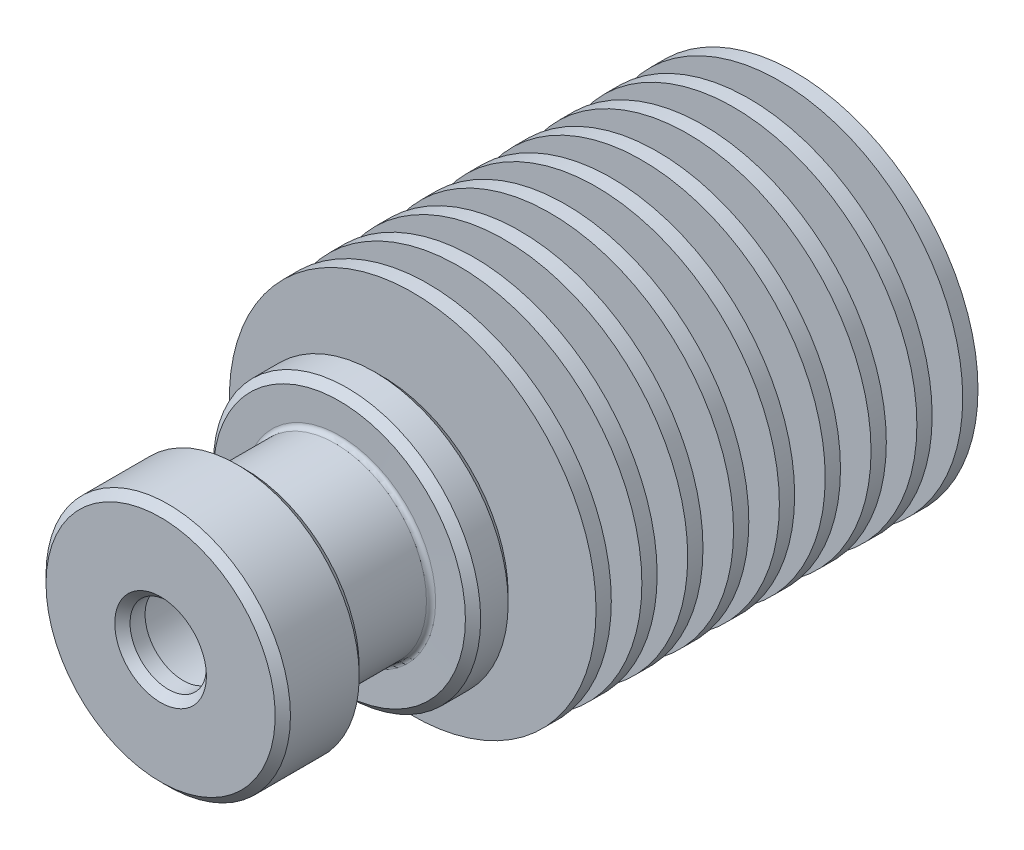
ISO-10303-21;
HEADER;
FILE_DESCRIPTION(('STEP AP214'),'2;1');
FILE_NAME('part.step','',(''),(''),'','','');
FILE_SCHEMA(('AUTOMOTIVE_DESIGN { 1 0 10303 214 1 1 1 1 }'));
ENDSEC;
DATA;
#1=APPLICATION_CONTEXT('core data for automotive mechanical design processes');
#2=APPLICATION_PROTOCOL_DEFINITION('international standard','automotive_design',2000,#1);
#3=PRODUCT_CONTEXT('',#1,'mechanical');
#4=PRODUCT('Part','Part','',(#3));
#5=PRODUCT_RELATED_PRODUCT_CATEGORY('part','',(#4));
#6=PRODUCT_DEFINITION_FORMATION('','',#4);
#7=PRODUCT_DEFINITION_CONTEXT('part definition',#1,'design');
#8=PRODUCT_DEFINITION('design','',#6,#7);
#9=PRODUCT_DEFINITION_SHAPE('','',#8);
#10=(LENGTH_UNIT() NAMED_UNIT(*) SI_UNIT(.MILLI.,.METRE.));
#11=(NAMED_UNIT(*) PLANE_ANGLE_UNIT() SI_UNIT($,.RADIAN.));
#12=(NAMED_UNIT(*) SI_UNIT($,.STERADIAN.) SOLID_ANGLE_UNIT());
#13=UNCERTAINTY_MEASURE_WITH_UNIT(LENGTH_MEASURE(1.E-05),#10,'distance_accuracy_value','');
#14=(GEOMETRIC_REPRESENTATION_CONTEXT(3) GLOBAL_UNCERTAINTY_ASSIGNED_CONTEXT((#13)) GLOBAL_UNIT_ASSIGNED_CONTEXT((#10,
#11,#12)) REPRESENTATION_CONTEXT('',''));
#15=CARTESIAN_POINT('',(0.,0.,0.));
#16=DIRECTION('',(0.,0.,1.));
#17=DIRECTION('',(1.,0.,0.));
#18=AXIS2_PLACEMENT_3D('',#15,#16,#17);
#19=CARTESIAN_POINT('',(0.,0.,0.));
#20=DIRECTION('',(0.,0.,1.));
#21=DIRECTION('',(1.,0.,0.));
#22=AXIS2_PLACEMENT_3D('',#19,#20,#21);
#23=CYLINDRICAL_SURFACE('',#22,12.);
#24=CARTESIAN_POINT('',(0.,0.,-21.0158219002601));
#25=DIRECTION('',(0.,0.,1.));
#26=DIRECTION('',(1.,0.,0.));
#27=AXIS2_PLACEMENT_3D('',#24,#25,#26);
#28=CIRCLE('',#27,12.);
#29=CARTESIAN_POINT('',(12.,0.,-21.0158219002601));
#30=VERTEX_POINT('',#29);
#31=EDGE_CURVE('E1146',#30,#30,#28,.F.);
#32=ORIENTED_EDGE('',*,*,#31,.T.);
#33=EDGE_LOOP('',(#32));
#34=FACE_BOUND('',#33,.T.);
#35=CARTESIAN_POINT('',(0.,0.,-22.0158219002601));
#36=DIRECTION('',(0.,0.,1.));
#37=DIRECTION('',(1.,0.,0.));
#38=AXIS2_PLACEMENT_3D('',#35,#36,#37);
#39=CIRCLE('',#38,12.);
#40=CARTESIAN_POINT('',(12.,0.,-22.0158219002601));
#41=VERTEX_POINT('',#40);
#42=EDGE_CURVE('E148',#41,#41,#39,.T.);
#43=ORIENTED_EDGE('',*,*,#42,.T.);
#44=EDGE_LOOP('',(#43));
#45=FACE_BOUND('',#44,.T.);
#46=ADVANCED_FACE('F17',(#34,#45),#23,.T.);
#47=CARTESIAN_POINT('',(0.,5.3,-21.0158219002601));
#48=DIRECTION('',(0.,0.,-1.));
#49=DIRECTION('',(-1.,0.,0.));
#50=AXIS2_PLACEMENT_3D('',#47,#48,#49);
#51=PLANE('',#50);
#52=ORIENTED_EDGE('',*,*,#31,.F.);
#53=EDGE_LOOP('',(#52));
#54=FACE_BOUND('',#53,.T.);
#55=CARTESIAN_POINT('',(0.,0.,-21.0158219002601));
#56=DIRECTION('',(0.,0.,1.));
#57=DIRECTION('',(-1.,0.,0.));
#58=AXIS2_PLACEMENT_3D('',#55,#56,#57);
#59=CIRCLE('',#58,5.3);
#60=CARTESIAN_POINT('',(5.3,0.,-21.0158219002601));
#61=VERTEX_POINT('',#60);
#62=CARTESIAN_POINT('',(-5.3,0.,-21.0158219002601));
#63=VERTEX_POINT('',#62);
#64=EDGE_CURVE('E144',#61,#63,#59,.F.);
#65=ORIENTED_EDGE('',*,*,#64,.T.);
#66=CARTESIAN_POINT('',(0.,0.,-21.0158219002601));
#67=DIRECTION('',(0.,0.,1.));
#68=DIRECTION('',(1.,0.,0.));
#69=AXIS2_PLACEMENT_3D('',#66,#67,#68);
#70=CIRCLE('',#69,5.3);
#71=EDGE_CURVE('E141',#63,#61,#70,.F.);
#72=ORIENTED_EDGE('',*,*,#71,.T.);
#73=EDGE_LOOP('',(#65,#72));
#74=FACE_BOUND('',#73,.T.);
#75=ADVANCED_FACE('F151',(#54,#74),#51,.F.);
#76=CARTESIAN_POINT('',(0.,6.3,-22.0158219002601));
#77=DIRECTION('',(0.,0.,1.));
#78=DIRECTION('',(1.,0.,0.));
#79=AXIS2_PLACEMENT_3D('',#76,#77,#78);
#80=PLANE('',#79);
#81=CARTESIAN_POINT('',(0.,0.,-22.0158219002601));
#82=DIRECTION('',(0.,0.,-1.));
#83=DIRECTION('',(1.,0.,0.));
#84=AXIS2_PLACEMENT_3D('',#81,#82,#83);
#85=CIRCLE('',#84,6.3);
#86=CARTESIAN_POINT('',(-6.3,0.,-22.0158219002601));
#87=VERTEX_POINT('',#86);
#88=CARTESIAN_POINT('',(6.3,0.,-22.0158219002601));
#89=VERTEX_POINT('',#88);
#90=EDGE_CURVE('E152',#87,#89,#85,.F.);
#91=ORIENTED_EDGE('',*,*,#90,.T.);
#92=CARTESIAN_POINT('',(0.,0.,-22.0158219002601));
#93=DIRECTION('',(0.,0.,-1.));
#94=DIRECTION('',(-1.,0.,0.));
#95=AXIS2_PLACEMENT_3D('',#92,#93,#94);
#96=CIRCLE('',#95,6.3);
#97=EDGE_CURVE('E194',#89,#87,#96,.F.);
#98=ORIENTED_EDGE('',*,*,#97,.T.);
#99=EDGE_LOOP('',(#91,#98));
#100=FACE_BOUND('',#99,.T.);
#101=ORIENTED_EDGE('',*,*,#42,.F.);
#102=EDGE_LOOP('',(#101));
#103=FACE_BOUND('',#102,.T.);
#104=ADVANCED_FACE('F168',(#100,#103),#80,.F.);
#105=CARTESIAN_POINT('',(0.,0.,-20.7158219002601));
#106=DIRECTION('',(0.,0.,1.));
#107=DIRECTION('',(1.,0.,0.));
#108=AXIS2_PLACEMENT_3D('',#105,#106,#107);
#109=TOROIDAL_SURFACE('',#108,5.3,0.300000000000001);
#110=CARTESIAN_POINT('',(0.,0.,-20.7158219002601));
#111=DIRECTION('',(0.,0.,1.));
#112=DIRECTION('',(1.,0.,0.));
#113=AXIS2_PLACEMENT_3D('',#110,#111,#112);
#114=CIRCLE('',#113,5.);
#115=CARTESIAN_POINT('',(5.,0.,-20.7158219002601));
#116=VERTEX_POINT('',#115);
#117=EDGE_CURVE('E197',#116,#116,#114,.T.);
#118=ORIENTED_EDGE('',*,*,#117,.F.);
#119=EDGE_LOOP('',(#118));
#120=FACE_BOUND('',#119,.T.);
#121=ORIENTED_EDGE('',*,*,#64,.F.);
#122=ORIENTED_EDGE('',*,*,#71,.F.);
#123=EDGE_LOOP('',(#121,#122));
#124=FACE_BOUND('',#123,.T.);
#125=ADVANCED_FACE('F145',(#120,#124),#109,.F.);
#126=CARTESIAN_POINT('',(0.,0.,-22.3158219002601));
#127=DIRECTION('',(0.,0.,1.));
#128=DIRECTION('',(1.,0.,0.));
#129=AXIS2_PLACEMENT_3D('',#126,#127,#128);
#130=TOROIDAL_SURFACE('',#129,6.3,0.300000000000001);
#131=ORIENTED_EDGE('',*,*,#97,.F.);
#132=ORIENTED_EDGE('',*,*,#90,.F.);
#133=EDGE_LOOP('',(#131,#132));
#134=FACE_BOUND('',#133,.T.);
#135=CARTESIAN_POINT('',(0.,0.,-22.3158219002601));
#136=DIRECTION('',(0.,0.,1.));
#137=DIRECTION('',(1.,0.,0.));
#138=AXIS2_PLACEMENT_3D('',#135,#136,#137);
#139=CIRCLE('',#138,6.);
#140=CARTESIAN_POINT('',(6.,0.,-22.3158219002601));
#141=VERTEX_POINT('',#140);
#142=EDGE_CURVE('E199',#141,#141,#139,.F.);
#143=ORIENTED_EDGE('',*,*,#142,.F.);
#144=EDGE_LOOP('',(#143));
#145=FACE_BOUND('',#144,.T.);
#146=ADVANCED_FACE('F210',(#134,#145),#130,.F.);
#147=CARTESIAN_POINT('',(0.,0.,0.));
#148=DIRECTION('',(0.,0.,1.));
#149=DIRECTION('',(1.,0.,0.));
#150=AXIS2_PLACEMENT_3D('',#147,#148,#149);
#151=CYLINDRICAL_SURFACE('',#150,5.);
#152=CARTESIAN_POINT('',(0.,0.,-19.3158219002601));
#153=DIRECTION('',(0.,0.,1.));
#154=DIRECTION('',(1.,0.,0.));
#155=AXIS2_PLACEMENT_3D('',#152,#153,#154);
#156=CIRCLE('',#155,5.);
#157=CARTESIAN_POINT('',(5.,0.,-19.3158219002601));
#158=VERTEX_POINT('',#157);
#159=EDGE_CURVE('E204',#158,#158,#156,.F.);
#160=ORIENTED_EDGE('',*,*,#159,.T.);
#161=EDGE_LOOP('',(#160));
#162=FACE_BOUND('',#161,.T.);
#163=ORIENTED_EDGE('',*,*,#117,.T.);
#164=EDGE_LOOP('',(#163));
#165=FACE_BOUND('',#164,.T.);
#166=ADVANCED_FACE('F214',(#162,#165),#151,.T.);
#167=CARTESIAN_POINT('',(0.,0.,0.));
#168=DIRECTION('',(0.,0.,1.));
#169=DIRECTION('',(1.,0.,0.));
#170=AXIS2_PLACEMENT_3D('',#167,#168,#169);
#171=CYLINDRICAL_SURFACE('',#170,6.);
#172=ORIENTED_EDGE('',*,*,#142,.T.);
#173=EDGE_LOOP('',(#172));
#174=FACE_BOUND('',#173,.T.);
#175=CARTESIAN_POINT('',(0.,0.,-23.7158219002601));
#176=DIRECTION('',(0.,0.,1.));
#177=DIRECTION('',(1.,0.,0.));
#178=AXIS2_PLACEMENT_3D('',#175,#176,#177);
#179=CIRCLE('',#178,6.);
#180=CARTESIAN_POINT('',(6.,0.,-23.7158219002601));
#181=VERTEX_POINT('',#180);
#182=EDGE_CURVE('E264',#181,#181,#179,.T.);
#183=ORIENTED_EDGE('',*,*,#182,.T.);
#184=EDGE_LOOP('',(#183));
#185=FACE_BOUND('',#184,.T.);
#186=ADVANCED_FACE('F246',(#174,#185),#171,.T.);
#187=CARTESIAN_POINT('',(0.,0.,-19.3158219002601));
#188=DIRECTION('',(0.,0.,1.));
#189=DIRECTION('',(1.,0.,0.));
#190=AXIS2_PLACEMENT_3D('',#187,#188,#189);
#191=TOROIDAL_SURFACE('',#190,5.3,0.300000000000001);
#192=CARTESIAN_POINT('',(0.,0.,-19.0158219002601));
#193=DIRECTION('',(0.,0.,-1.));
#194=DIRECTION('',(-1.,0.,0.));
#195=AXIS2_PLACEMENT_3D('',#192,#193,#194);
#196=CIRCLE('',#195,5.3);
#197=CARTESIAN_POINT('',(-5.3,0.,-19.0158219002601));
#198=VERTEX_POINT('',#197);
#199=CARTESIAN_POINT('',(5.3,0.,-19.0158219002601));
#200=VERTEX_POINT('',#199);
#201=EDGE_CURVE('E260',#198,#200,#196,.T.);
#202=ORIENTED_EDGE('',*,*,#201,.T.);
#203=CARTESIAN_POINT('',(0.,0.,-19.0158219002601));
#204=DIRECTION('',(0.,0.,-1.));
#205=DIRECTION('',(1.,0.,0.));
#206=AXIS2_PLACEMENT_3D('',#203,#204,#205);
#207=CIRCLE('',#206,5.3);
#208=EDGE_CURVE('E271',#200,#198,#207,.T.);
#209=ORIENTED_EDGE('',*,*,#208,.T.);
#210=EDGE_LOOP('',(#202,#209));
#211=FACE_BOUND('',#210,.T.);
#212=ORIENTED_EDGE('',*,*,#159,.F.);
#213=EDGE_LOOP('',(#212));
#214=FACE_BOUND('',#213,.T.);
#215=ADVANCED_FACE('F235',(#211,#214),#191,.F.);
#216=CARTESIAN_POINT('',(0.,0.,-23.7158219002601));
#217=DIRECTION('',(0.,0.,1.));
#218=DIRECTION('',(1.,0.,0.));
#219=AXIS2_PLACEMENT_3D('',#216,#217,#218);
#220=TOROIDAL_SURFACE('',#219,6.3,0.300000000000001);
#221=ORIENTED_EDGE('',*,*,#182,.F.);
#222=EDGE_LOOP('',(#221));
#223=FACE_BOUND('',#222,.T.);
#224=CARTESIAN_POINT('',(0.,0.,-24.0158219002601));
#225=DIRECTION('',(0.,0.,1.));
#226=DIRECTION('',(-1.,0.,0.));
#227=AXIS2_PLACEMENT_3D('',#224,#225,#226);
#228=CIRCLE('',#227,6.3);
#229=CARTESIAN_POINT('',(-6.3,0.,-24.0158219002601));
#230=VERTEX_POINT('',#229);
#231=CARTESIAN_POINT('',(6.3,0.,-24.0158219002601));
#232=VERTEX_POINT('',#231);
#233=EDGE_CURVE('E1083',#230,#232,#228,.T.);
#234=ORIENTED_EDGE('',*,*,#233,.T.);
#235=CARTESIAN_POINT('',(0.,0.,-24.0158219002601));
#236=DIRECTION('',(0.,0.,1.));
#237=DIRECTION('',(1.,0.,0.));
#238=AXIS2_PLACEMENT_3D('',#235,#236,#237);
#239=CIRCLE('',#238,6.3);
#240=EDGE_CURVE('E1132',#232,#230,#239,.T.);
#241=ORIENTED_EDGE('',*,*,#240,.T.);
#242=EDGE_LOOP('',(#234,#241));
#243=FACE_BOUND('',#242,.T.);
#244=ADVANCED_FACE('F245',(#223,#243),#220,.F.);
#245=CARTESIAN_POINT('',(0.,5.3,-19.0158219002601));
#246=DIRECTION('',(0.,0.,1.));
#247=DIRECTION('',(1.,0.,0.));
#248=AXIS2_PLACEMENT_3D('',#245,#246,#247);
#249=PLANE('',#248);
#250=ORIENTED_EDGE('',*,*,#208,.F.);
#251=ORIENTED_EDGE('',*,*,#201,.F.);
#252=EDGE_LOOP('',(#250,#251));
#253=FACE_BOUND('',#252,.T.);
#254=CARTESIAN_POINT('',(0.,0.,-19.0158219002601));
#255=DIRECTION('',(0.,0.,1.));
#256=DIRECTION('',(1.,0.,0.));
#257=AXIS2_PLACEMENT_3D('',#254,#255,#256);
#258=CIRCLE('',#257,12.);
#259=CARTESIAN_POINT('',(12.,0.,-19.0158219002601));
#260=VERTEX_POINT('',#259);
#261=EDGE_CURVE('E1134',#260,#260,#258,.T.);
#262=ORIENTED_EDGE('',*,*,#261,.F.);
#263=EDGE_LOOP('',(#262));
#264=FACE_BOUND('',#263,.T.);
#265=ADVANCED_FACE('F1100',(#253,#264),#249,.F.);
#266=CARTESIAN_POINT('',(0.,6.3,-24.0158219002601));
#267=DIRECTION('',(0.,0.,-1.));
#268=DIRECTION('',(-1.,0.,0.));
#269=AXIS2_PLACEMENT_3D('',#266,#267,#268);
#270=PLANE('',#269);
#271=CARTESIAN_POINT('',(0.,0.,-24.0158219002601));
#272=DIRECTION('',(0.,0.,1.));
#273=DIRECTION('',(1.,0.,0.));
#274=AXIS2_PLACEMENT_3D('',#271,#272,#273);
#275=CIRCLE('',#274,12.);
#276=CARTESIAN_POINT('',(12.,0.,-24.0158219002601));
#277=VERTEX_POINT('',#276);
#278=EDGE_CURVE('E1136',#277,#277,#275,.F.);
#279=ORIENTED_EDGE('',*,*,#278,.F.);
#280=EDGE_LOOP('',(#279));
#281=FACE_BOUND('',#280,.T.);
#282=ORIENTED_EDGE('',*,*,#233,.F.);
#283=ORIENTED_EDGE('',*,*,#240,.F.);
#284=EDGE_LOOP('',(#282,#283));
#285=FACE_BOUND('',#284,.T.);
#286=ADVANCED_FACE('F1090',(#281,#285),#270,.F.);
#287=CARTESIAN_POINT('',(0.,0.,0.));
#288=DIRECTION('',(0.,0.,1.));
#289=DIRECTION('',(1.,0.,0.));
#290=AXIS2_PLACEMENT_3D('',#287,#288,#289);
#291=CYLINDRICAL_SURFACE('',#290,12.);
#292=CARTESIAN_POINT('',(0.,0.,-18.0158219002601));
#293=DIRECTION('',(0.,0.,1.));
#294=DIRECTION('',(1.,0.,0.));
#295=AXIS2_PLACEMENT_3D('',#292,#293,#294);
#296=CIRCLE('',#295,12.);
#297=CARTESIAN_POINT('',(12.,0.,-18.0158219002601));
#298=VERTEX_POINT('',#297);
#299=EDGE_CURVE('E1141',#298,#298,#296,.F.);
#300=ORIENTED_EDGE('',*,*,#299,.T.);
#301=EDGE_LOOP('',(#300));
#302=FACE_BOUND('',#301,.T.);
#303=ORIENTED_EDGE('',*,*,#261,.T.);
#304=EDGE_LOOP('',(#303));
#305=FACE_BOUND('',#304,.T.);
#306=ADVANCED_FACE('F1099',(#302,#305),#291,.T.);
#307=CARTESIAN_POINT('',(0.,0.,0.));
#308=DIRECTION('',(0.,0.,1.));
#309=DIRECTION('',(1.,0.,0.));
#310=AXIS2_PLACEMENT_3D('',#307,#308,#309);
#311=CYLINDRICAL_SURFACE('',#310,12.);
#312=ORIENTED_EDGE('',*,*,#278,.T.);
#313=EDGE_LOOP('',(#312));
#314=FACE_BOUND('',#313,.T.);
#315=CARTESIAN_POINT('',(0.,0.,-25.0158219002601));
#316=DIRECTION('',(0.,0.,1.));
#317=DIRECTION('',(1.,0.,0.));
#318=AXIS2_PLACEMENT_3D('',#315,#316,#317);
#319=CIRCLE('',#318,12.);
#320=CARTESIAN_POINT('',(12.,0.,-25.0158219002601));
#321=VERTEX_POINT('',#320);
#322=EDGE_CURVE('E1746',#321,#321,#319,.T.);
#323=ORIENTED_EDGE('',*,*,#322,.T.);
#324=EDGE_LOOP('',(#323));
#325=FACE_BOUND('',#324,.T.);
#326=ADVANCED_FACE('F1224',(#314,#325),#311,.T.);
#327=CARTESIAN_POINT('',(0.,5.3,-18.0158219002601));
#328=DIRECTION('',(0.,0.,-1.));
#329=DIRECTION('',(-1.,0.,0.));
#330=AXIS2_PLACEMENT_3D('',#327,#328,#329);
#331=PLANE('',#330);
#332=ORIENTED_EDGE('',*,*,#299,.F.);
#333=EDGE_LOOP('',(#332));
#334=FACE_BOUND('',#333,.T.);
#335=CARTESIAN_POINT('',(0.,0.,-18.0158219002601));
#336=DIRECTION('',(0.,0.,1.));
#337=DIRECTION('',(-1.,0.,0.));
#338=AXIS2_PLACEMENT_3D('',#335,#336,#337);
#339=CIRCLE('',#338,5.3);
#340=CARTESIAN_POINT('',(5.3,0.,-18.0158219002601));
#341=VERTEX_POINT('',#340);
#342=CARTESIAN_POINT('',(-5.3,0.,-18.0158219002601));
#343=VERTEX_POINT('',#342);
#344=EDGE_CURVE('E1051',#341,#343,#339,.F.);
#345=ORIENTED_EDGE('',*,*,#344,.T.);
#346=CARTESIAN_POINT('',(0.,0.,-18.0158219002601));
#347=DIRECTION('',(0.,0.,1.));
#348=DIRECTION('',(1.,0.,0.));
#349=AXIS2_PLACEMENT_3D('',#346,#347,#348);
#350=CIRCLE('',#349,5.3);
#351=EDGE_CURVE('E1061',#343,#341,#350,.F.);
#352=ORIENTED_EDGE('',*,*,#351,.T.);
#353=EDGE_LOOP('',(#345,#352));
#354=FACE_BOUND('',#353,.T.);
#355=ADVANCED_FACE('F1027',(#334,#354),#331,.F.);
#356=CARTESIAN_POINT('',(0.,12.,-25.0158219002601));
#357=DIRECTION('',(0.,0.,1.));
#358=DIRECTION('',(1.,0.,0.));
#359=AXIS2_PLACEMENT_3D('',#356,#357,#358);
#360=PLANE('',#359);
#361=CARTESIAN_POINT('',(0.,0.,-25.0158219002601));
#362=DIRECTION('',(0.,0.,-1.));
#363=DIRECTION('',(1.,0.,0.));
#364=AXIS2_PLACEMENT_3D('',#361,#362,#363);
#365=CIRCLE('',#364,6.26251687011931);
#366=CARTESIAN_POINT('',(-6.26251687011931,0.,-25.0158219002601));
#367=VERTEX_POINT('',#366);
#368=CARTESIAN_POINT('',(6.26251687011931,0.,-25.0158219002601));
#369=VERTEX_POINT('',#368);
#370=EDGE_CURVE('E977',#367,#369,#365,.F.);
#371=ORIENTED_EDGE('',*,*,#370,.T.);
#372=CARTESIAN_POINT('',(0.,0.,-25.0158219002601));
#373=DIRECTION('',(0.,0.,-1.));
#374=DIRECTION('',(-1.,0.,0.));
#375=AXIS2_PLACEMENT_3D('',#372,#373,#374);
#376=CIRCLE('',#375,6.26251687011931);
#377=EDGE_CURVE('E1009',#369,#367,#376,.F.);
#378=ORIENTED_EDGE('',*,*,#377,.T.);
#379=EDGE_LOOP('',(#371,#378));
#380=FACE_BOUND('',#379,.T.);
#381=ORIENTED_EDGE('',*,*,#322,.F.);
#382=EDGE_LOOP('',(#381));
#383=FACE_BOUND('',#382,.T.);
#384=ADVANCED_FACE('F1018',(#380,#383),#360,.F.);
#385=CARTESIAN_POINT('',(0.,0.,-17.7158219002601));
#386=DIRECTION('',(0.,0.,1.));
#387=DIRECTION('',(1.,0.,0.));
#388=AXIS2_PLACEMENT_3D('',#385,#386,#387);
#389=TOROIDAL_SURFACE('',#388,5.3,0.299999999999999);
#390=CARTESIAN_POINT('',(0.,0.,-17.7158219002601));
#391=DIRECTION('',(0.,0.,1.));
#392=DIRECTION('',(1.,0.,0.));
#393=AXIS2_PLACEMENT_3D('',#390,#391,#392);
#394=CIRCLE('',#393,5.);
#395=CARTESIAN_POINT('',(5.,0.,-17.7158219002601));
#396=VERTEX_POINT('',#395);
#397=EDGE_CURVE('E1007',#396,#396,#394,.T.);
#398=ORIENTED_EDGE('',*,*,#397,.F.);
#399=EDGE_LOOP('',(#398));
#400=FACE_BOUND('',#399,.T.);
#401=ORIENTED_EDGE('',*,*,#344,.F.);
#402=ORIENTED_EDGE('',*,*,#351,.F.);
#403=EDGE_LOOP('',(#401,#402));
#404=FACE_BOUND('',#403,.T.);
#405=ADVANCED_FACE('F996',(#400,#404),#389,.F.);
#406=CARTESIAN_POINT('',(0.,0.,-25.3158219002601));
#407=DIRECTION('',(0.,0.,1.));
#408=DIRECTION('',(1.,0.,0.));
#409=AXIS2_PLACEMENT_3D('',#406,#407,#408);
#410=TOROIDAL_SURFACE('',#409,6.26251687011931,0.300000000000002);
#411=ORIENTED_EDGE('',*,*,#377,.F.);
#412=ORIENTED_EDGE('',*,*,#370,.F.);
#413=EDGE_LOOP('',(#411,#412));
#414=FACE_BOUND('',#413,.T.);
#415=CARTESIAN_POINT('',(0.,0.,-25.3158219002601));
#416=DIRECTION('',(0.,0.,1.));
#417=DIRECTION('',(1.,0.,0.));
#418=AXIS2_PLACEMENT_3D('',#415,#416,#417);
#419=CIRCLE('',#418,5.96251687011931);
#420=CARTESIAN_POINT('',(5.96251687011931,0.,-25.3158219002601));
#421=VERTEX_POINT('',#420);
#422=EDGE_CURVE('E1005',#421,#421,#419,.F.);
#423=ORIENTED_EDGE('',*,*,#422,.F.);
#424=EDGE_LOOP('',(#423));
#425=FACE_BOUND('',#424,.T.);
#426=ADVANCED_FACE('F984',(#414,#425),#410,.F.);
#427=CARTESIAN_POINT('',(0.,0.,0.));
#428=DIRECTION('',(0.,0.,1.));
#429=DIRECTION('',(1.,0.,0.));
#430=AXIS2_PLACEMENT_3D('',#427,#428,#429);
#431=CYLINDRICAL_SURFACE('',#430,5.);
#432=CARTESIAN_POINT('',(0.,0.,-16.3158219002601));
#433=DIRECTION('',(0.,0.,1.));
#434=DIRECTION('',(1.,0.,0.));
#435=AXIS2_PLACEMENT_3D('',#432,#433,#434);
#436=CIRCLE('',#435,5.);
#437=CARTESIAN_POINT('',(5.,0.,-16.3158219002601));
#438=VERTEX_POINT('',#437);
#439=EDGE_CURVE('E1759',#438,#438,#436,.F.);
#440=ORIENTED_EDGE('',*,*,#439,.T.);
#441=EDGE_LOOP('',(#440));
#442=FACE_BOUND('',#441,.T.);
#443=ORIENTED_EDGE('',*,*,#397,.T.);
#444=EDGE_LOOP('',(#443));
#445=FACE_BOUND('',#444,.T.);
#446=ADVANCED_FACE('F995',(#442,#445),#431,.T.);
#447=CARTESIAN_POINT('',(0.,0.,0.));
#448=DIRECTION('',(0.,0.,1.));
#449=DIRECTION('',(1.,0.,0.));
#450=AXIS2_PLACEMENT_3D('',#447,#448,#449);
#451=CYLINDRICAL_SURFACE('',#450,5.96251687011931);
#452=ORIENTED_EDGE('',*,*,#422,.T.);
#453=EDGE_LOOP('',(#452));
#454=FACE_BOUND('',#453,.T.);
#455=CARTESIAN_POINT('',(0.,0.,-26.7158219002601));
#456=DIRECTION('',(0.,0.,1.));
#457=DIRECTION('',(1.,0.,0.));
#458=AXIS2_PLACEMENT_3D('',#455,#456,#457);
#459=CIRCLE('',#458,5.96251687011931);
#460=CARTESIAN_POINT('',(5.96251687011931,0.,-26.7158219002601));
#461=VERTEX_POINT('',#460);
#462=EDGE_CURVE('E1757',#461,#461,#459,.T.);
#463=ORIENTED_EDGE('',*,*,#462,.T.);
#464=EDGE_LOOP('',(#463));
#465=FACE_BOUND('',#464,.T.);
#466=ADVANCED_FACE('F1269',(#454,#465),#451,.T.);
#467=CARTESIAN_POINT('',(0.,0.,-16.3158219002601));
#468=DIRECTION('',(0.,0.,1.));
#469=DIRECTION('',(1.,0.,0.));
#470=AXIS2_PLACEMENT_3D('',#467,#468,#469);
#471=TOROIDAL_SURFACE('',#470,5.3,0.300000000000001);
#472=CARTESIAN_POINT('',(0.,0.,-16.0158219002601));
#473=DIRECTION('',(0.,0.,-1.));
#474=DIRECTION('',(-1.,0.,0.));
#475=AXIS2_PLACEMENT_3D('',#472,#473,#474);
#476=CIRCLE('',#475,5.3);
#477=CARTESIAN_POINT('',(-5.3,0.,-16.0158219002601));
#478=VERTEX_POINT('',#477);
#479=CARTESIAN_POINT('',(5.3,0.,-16.0158219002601));
#480=VERTEX_POINT('',#479);
#481=EDGE_CURVE('E930',#478,#480,#476,.T.);
#482=ORIENTED_EDGE('',*,*,#481,.T.);
#483=CARTESIAN_POINT('',(0.,0.,-16.0158219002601));
#484=DIRECTION('',(0.,0.,-1.));
#485=DIRECTION('',(1.,0.,0.));
#486=AXIS2_PLACEMENT_3D('',#483,#484,#485);
#487=CIRCLE('',#486,5.3);
#488=EDGE_CURVE('E919',#480,#478,#487,.T.);
#489=ORIENTED_EDGE('',*,*,#488,.T.);
#490=EDGE_LOOP('',(#482,#489));
#491=FACE_BOUND('',#490,.T.);
#492=ORIENTED_EDGE('',*,*,#439,.F.);
#493=EDGE_LOOP('',(#492));
#494=FACE_BOUND('',#493,.T.);
#495=ADVANCED_FACE('F946',(#491,#494),#471,.F.);
#496=CARTESIAN_POINT('',(0.,0.,-26.7158219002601));
#497=DIRECTION('',(0.,0.,1.));
#498=DIRECTION('',(1.,0.,0.));
#499=AXIS2_PLACEMENT_3D('',#496,#497,#498);
#500=TOROIDAL_SURFACE('',#499,6.26251687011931,0.300000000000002);
#501=ORIENTED_EDGE('',*,*,#462,.F.);
#502=EDGE_LOOP('',(#501));
#503=FACE_BOUND('',#502,.T.);
#504=CARTESIAN_POINT('',(0.,0.,-27.0158219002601));
#505=DIRECTION('',(0.,0.,1.));
#506=DIRECTION('',(-1.,0.,0.));
#507=AXIS2_PLACEMENT_3D('',#504,#505,#506);
#508=CIRCLE('',#507,6.26251687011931);
#509=CARTESIAN_POINT('',(-6.26251687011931,0.,-27.0158219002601));
#510=VERTEX_POINT('',#509);
#511=CARTESIAN_POINT('',(6.26251687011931,0.,-27.0158219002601));
#512=VERTEX_POINT('',#511);
#513=EDGE_CURVE('E885',#510,#512,#508,.T.);
#514=ORIENTED_EDGE('',*,*,#513,.T.);
#515=CARTESIAN_POINT('',(0.,0.,-27.0158219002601));
#516=DIRECTION('',(0.,0.,1.));
#517=DIRECTION('',(1.,0.,0.));
#518=AXIS2_PLACEMENT_3D('',#515,#516,#517);
#519=CIRCLE('',#518,6.26251687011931);
#520=EDGE_CURVE('E1745',#512,#510,#519,.T.);
#521=ORIENTED_EDGE('',*,*,#520,.T.);
#522=EDGE_LOOP('',(#514,#521));
#523=FACE_BOUND('',#522,.T.);
#524=ADVANCED_FACE('F942',(#503,#523),#500,.F.);
#525=CARTESIAN_POINT('',(0.,5.3,-16.0158219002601));
#526=DIRECTION('',(0.,0.,1.));
#527=DIRECTION('',(1.,0.,0.));
#528=AXIS2_PLACEMENT_3D('',#525,#526,#527);
#529=PLANE('',#528);
#530=ORIENTED_EDGE('',*,*,#488,.F.);
#531=ORIENTED_EDGE('',*,*,#481,.F.);
#532=EDGE_LOOP('',(#530,#531));
#533=FACE_BOUND('',#532,.T.);
#534=CARTESIAN_POINT('',(0.,0.,-16.0158219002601));
#535=DIRECTION('',(0.,0.,1.));
#536=DIRECTION('',(1.,0.,0.));
#537=AXIS2_PLACEMENT_3D('',#534,#535,#536);
#538=CIRCLE('',#537,12.);
#539=CARTESIAN_POINT('',(12.,0.,-16.0158219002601));
#540=VERTEX_POINT('',#539);
#541=EDGE_CURVE('E1742',#540,#540,#538,.T.);
#542=ORIENTED_EDGE('',*,*,#541,.F.);
#543=EDGE_LOOP('',(#542));
#544=FACE_BOUND('',#543,.T.);
#545=ADVANCED_FACE('F903',(#533,#544),#529,.F.);
#546=CARTESIAN_POINT('',(0.,6.26251687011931,-27.0158219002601));
#547=DIRECTION('',(0.,0.,-1.));
#548=DIRECTION('',(-1.,0.,0.));
#549=AXIS2_PLACEMENT_3D('',#546,#547,#548);
#550=PLANE('',#549);
#551=CARTESIAN_POINT('',(0.,0.,-27.0158219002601));
#552=DIRECTION('',(0.,0.,1.));
#553=DIRECTION('',(1.,0.,0.));
#554=AXIS2_PLACEMENT_3D('',#551,#552,#553);
#555=CIRCLE('',#554,12.);
#556=CARTESIAN_POINT('',(12.,0.,-27.0158219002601));
#557=VERTEX_POINT('',#556);
#558=EDGE_CURVE('E1739',#557,#557,#555,.F.);
#559=ORIENTED_EDGE('',*,*,#558,.F.);
#560=EDGE_LOOP('',(#559));
#561=FACE_BOUND('',#560,.T.);
#562=ORIENTED_EDGE('',*,*,#513,.F.);
#563=ORIENTED_EDGE('',*,*,#520,.F.);
#564=EDGE_LOOP('',(#562,#563));
#565=FACE_BOUND('',#564,.T.);
#566=ADVANCED_FACE('F892',(#561,#565),#550,.F.);
#567=CARTESIAN_POINT('',(0.,0.,0.));
#568=DIRECTION('',(0.,0.,1.));
#569=DIRECTION('',(1.,0.,0.));
#570=AXIS2_PLACEMENT_3D('',#567,#568,#569);
#571=CYLINDRICAL_SURFACE('',#570,12.);
#572=CARTESIAN_POINT('',(0.,0.,-15.0158219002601));
#573=DIRECTION('',(0.,0.,1.));
#574=DIRECTION('',(1.,0.,0.));
#575=AXIS2_PLACEMENT_3D('',#572,#573,#574);
#576=CIRCLE('',#575,12.);
#577=CARTESIAN_POINT('',(12.,0.,-15.0158219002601));
#578=VERTEX_POINT('',#577);
#579=EDGE_CURVE('E1736',#578,#578,#576,.F.);
#580=ORIENTED_EDGE('',*,*,#579,.T.);
#581=EDGE_LOOP('',(#580));
#582=FACE_BOUND('',#581,.T.);
#583=ORIENTED_EDGE('',*,*,#541,.T.);
#584=EDGE_LOOP('',(#583));
#585=FACE_BOUND('',#584,.T.);
#586=ADVANCED_FACE('F902',(#582,#585),#571,.T.);
#587=CARTESIAN_POINT('',(0.,0.,0.));
#588=DIRECTION('',(0.,0.,1.));
#589=DIRECTION('',(1.,0.,0.));
#590=AXIS2_PLACEMENT_3D('',#587,#588,#589);
#591=CYLINDRICAL_SURFACE('',#590,12.);
#592=ORIENTED_EDGE('',*,*,#558,.T.);
#593=EDGE_LOOP('',(#592));
#594=FACE_BOUND('',#593,.T.);
#595=CARTESIAN_POINT('',(0.,0.,-28.0158219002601));
#596=DIRECTION('',(0.,0.,1.));
#597=DIRECTION('',(1.,0.,0.));
#598=AXIS2_PLACEMENT_3D('',#595,#596,#597);
#599=CIRCLE('',#598,12.);
#600=CARTESIAN_POINT('',(12.,0.,-28.0158219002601));
#601=VERTEX_POINT('',#600);
#602=EDGE_CURVE('E1733',#601,#601,#599,.T.);
#603=ORIENTED_EDGE('',*,*,#602,.T.);
#604=EDGE_LOOP('',(#603));
#605=FACE_BOUND('',#604,.T.);
#606=ADVANCED_FACE('F1312',(#594,#605),#591,.T.);
#607=CARTESIAN_POINT('',(0.,5.3,-15.0158219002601));
#608=DIRECTION('',(0.,0.,-1.));
#609=DIRECTION('',(-1.,0.,0.));
#610=AXIS2_PLACEMENT_3D('',#607,#608,#609);
#611=PLANE('',#610);
#612=ORIENTED_EDGE('',*,*,#579,.F.);
#613=EDGE_LOOP('',(#612));
#614=FACE_BOUND('',#613,.T.);
#615=CARTESIAN_POINT('',(0.,0.,-15.0158219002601));
#616=DIRECTION('',(0.,0.,1.));
#617=DIRECTION('',(-1.,0.,0.));
#618=AXIS2_PLACEMENT_3D('',#615,#616,#617);
#619=CIRCLE('',#618,5.3);
#620=CARTESIAN_POINT('',(5.3,0.,-15.0158219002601));
#621=VERTEX_POINT('',#620);
#622=CARTESIAN_POINT('',(-5.3,0.,-15.0158219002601));
#623=VERTEX_POINT('',#622);
#624=EDGE_CURVE('E853',#621,#623,#619,.F.);
#625=ORIENTED_EDGE('',*,*,#624,.T.);
#626=CARTESIAN_POINT('',(0.,0.,-15.0158219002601));
#627=DIRECTION('',(0.,0.,1.));
#628=DIRECTION('',(1.,0.,0.));
#629=AXIS2_PLACEMENT_3D('',#626,#627,#628);
#630=CIRCLE('',#629,5.3);
#631=EDGE_CURVE('E863',#623,#621,#630,.F.);
#632=ORIENTED_EDGE('',*,*,#631,.T.);
#633=EDGE_LOOP('',(#625,#632));
#634=FACE_BOUND('',#633,.T.);
#635=ADVANCED_FACE('F829',(#614,#634),#611,.F.);
#636=CARTESIAN_POINT('',(0.,12.,-28.0158219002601));
#637=DIRECTION('',(0.,0.,1.));
#638=DIRECTION('',(1.,0.,0.));
#639=AXIS2_PLACEMENT_3D('',#636,#637,#638);
#640=PLANE('',#639);
#641=CARTESIAN_POINT('',(0.,0.,-28.0158219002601));
#642=DIRECTION('',(0.,0.,-1.));
#643=DIRECTION('',(1.,0.,0.));
#644=AXIS2_PLACEMENT_3D('',#641,#642,#643);
#645=CIRCLE('',#644,6.26251687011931);
#646=CARTESIAN_POINT('',(-6.26251687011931,0.,-28.0158219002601));
#647=VERTEX_POINT('',#646);
#648=CARTESIAN_POINT('',(6.26251687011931,0.,-28.0158219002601));
#649=VERTEX_POINT('',#648);
#650=EDGE_CURVE('E779',#647,#649,#645,.F.);
#651=ORIENTED_EDGE('',*,*,#650,.T.);
#652=CARTESIAN_POINT('',(0.,0.,-28.0158219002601));
#653=DIRECTION('',(0.,0.,-1.));
#654=DIRECTION('',(-1.,0.,0.));
#655=AXIS2_PLACEMENT_3D('',#652,#653,#654);
#656=CIRCLE('',#655,6.26251687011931);
#657=EDGE_CURVE('E811',#649,#647,#656,.F.);
#658=ORIENTED_EDGE('',*,*,#657,.T.);
#659=EDGE_LOOP('',(#651,#658));
#660=FACE_BOUND('',#659,.T.);
#661=ORIENTED_EDGE('',*,*,#602,.F.);
#662=EDGE_LOOP('',(#661));
#663=FACE_BOUND('',#662,.T.);
#664=ADVANCED_FACE('F820',(#660,#663),#640,.F.);
#665=CARTESIAN_POINT('',(0.,0.,-14.7158219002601));
#666=DIRECTION('',(0.,0.,1.));
#667=DIRECTION('',(1.,0.,0.));
#668=AXIS2_PLACEMENT_3D('',#665,#666,#667);
#669=TOROIDAL_SURFACE('',#668,5.3,0.3);
#670=CARTESIAN_POINT('',(0.,0.,-14.7158219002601));
#671=DIRECTION('',(0.,0.,1.));
#672=DIRECTION('',(1.,0.,0.));
#673=AXIS2_PLACEMENT_3D('',#670,#671,#672);
#674=CIRCLE('',#673,5.);
#675=CARTESIAN_POINT('',(5.,0.,-14.7158219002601));
#676=VERTEX_POINT('',#675);
#677=EDGE_CURVE('E809',#676,#676,#674,.T.);
#678=ORIENTED_EDGE('',*,*,#677,.F.);
#679=EDGE_LOOP('',(#678));
#680=FACE_BOUND('',#679,.T.);
#681=ORIENTED_EDGE('',*,*,#624,.F.);
#682=ORIENTED_EDGE('',*,*,#631,.F.);
#683=EDGE_LOOP('',(#681,#682));
#684=FACE_BOUND('',#683,.T.);
#685=ADVANCED_FACE('F798',(#680,#684),#669,.F.);
#686=CARTESIAN_POINT('',(0.,0.,-28.3158219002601));
#687=DIRECTION('',(0.,0.,1.));
#688=DIRECTION('',(1.,0.,0.));
#689=AXIS2_PLACEMENT_3D('',#686,#687,#688);
#690=TOROIDAL_SURFACE('',#689,6.26251687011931,0.300000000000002);
#691=ORIENTED_EDGE('',*,*,#657,.F.);
#692=ORIENTED_EDGE('',*,*,#650,.F.);
#693=EDGE_LOOP('',(#691,#692));
#694=FACE_BOUND('',#693,.T.);
#695=CARTESIAN_POINT('',(0.,0.,-28.3158219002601));
#696=DIRECTION('',(0.,0.,1.));
#697=DIRECTION('',(1.,0.,0.));
#698=AXIS2_PLACEMENT_3D('',#695,#696,#697);
#699=CIRCLE('',#698,5.96251687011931);
#700=CARTESIAN_POINT('',(5.96251687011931,0.,-28.3158219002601));
#701=VERTEX_POINT('',#700);
#702=EDGE_CURVE('E807',#701,#701,#699,.F.);
#703=ORIENTED_EDGE('',*,*,#702,.F.);
#704=EDGE_LOOP('',(#703));
#705=FACE_BOUND('',#704,.T.);
#706=ADVANCED_FACE('F786',(#694,#705),#690,.F.);
#707=CARTESIAN_POINT('',(0.,0.,0.));
#708=DIRECTION('',(0.,0.,1.));
#709=DIRECTION('',(1.,0.,0.));
#710=AXIS2_PLACEMENT_3D('',#707,#708,#709);
#711=CYLINDRICAL_SURFACE('',#710,5.);
#712=CARTESIAN_POINT('',(0.,0.,-13.3158219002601));
#713=DIRECTION('',(0.,0.,1.));
#714=DIRECTION('',(1.,0.,0.));
#715=AXIS2_PLACEMENT_3D('',#712,#713,#714);
#716=CIRCLE('',#715,5.);
#717=CARTESIAN_POINT('',(5.,0.,-13.3158219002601));
#718=VERTEX_POINT('',#717);
#719=EDGE_CURVE('E1791',#718,#718,#716,.F.);
#720=ORIENTED_EDGE('',*,*,#719,.T.);
#721=EDGE_LOOP('',(#720));
#722=FACE_BOUND('',#721,.T.);
#723=ORIENTED_EDGE('',*,*,#677,.T.);
#724=EDGE_LOOP('',(#723));
#725=FACE_BOUND('',#724,.T.);
#726=ADVANCED_FACE('F797',(#722,#725),#711,.T.);
#727=CARTESIAN_POINT('',(0.,0.,0.));
#728=DIRECTION('',(0.,0.,1.));
#729=DIRECTION('',(1.,0.,0.));
#730=AXIS2_PLACEMENT_3D('',#727,#728,#729);
#731=CYLINDRICAL_SURFACE('',#730,5.96251687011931);
#732=ORIENTED_EDGE('',*,*,#702,.T.);
#733=EDGE_LOOP('',(#732));
#734=FACE_BOUND('',#733,.T.);
#735=CARTESIAN_POINT('',(0.,0.,-29.7158219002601));
#736=DIRECTION('',(0.,0.,1.));
#737=DIRECTION('',(1.,0.,0.));
#738=AXIS2_PLACEMENT_3D('',#735,#736,#737);
#739=CIRCLE('',#738,5.96251687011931);
#740=CARTESIAN_POINT('',(5.96251687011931,0.,-29.7158219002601));
#741=VERTEX_POINT('',#740);
#742=EDGE_CURVE('E1789',#741,#741,#739,.T.);
#743=ORIENTED_EDGE('',*,*,#742,.T.);
#744=EDGE_LOOP('',(#743));
#745=FACE_BOUND('',#744,.T.);
#746=ADVANCED_FACE('F1357',(#734,#745),#731,.T.);
#747=CARTESIAN_POINT('',(0.,0.,-13.3158219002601));
#748=DIRECTION('',(0.,0.,1.));
#749=DIRECTION('',(1.,0.,0.));
#750=AXIS2_PLACEMENT_3D('',#747,#748,#749);
#751=TOROIDAL_SURFACE('',#750,5.3,0.3);
#752=CARTESIAN_POINT('',(0.,0.,-13.0158219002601));
#753=DIRECTION('',(0.,0.,-1.));
#754=DIRECTION('',(-1.,0.,0.));
#755=AXIS2_PLACEMENT_3D('',#752,#753,#754);
#756=CIRCLE('',#755,5.3);
#757=CARTESIAN_POINT('',(-5.3,0.,-13.0158219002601));
#758=VERTEX_POINT('',#757);
#759=CARTESIAN_POINT('',(5.3,0.,-13.0158219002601));
#760=VERTEX_POINT('',#759);
#761=EDGE_CURVE('E734',#758,#760,#756,.T.);
#762=ORIENTED_EDGE('',*,*,#761,.T.);
#763=CARTESIAN_POINT('',(0.,0.,-13.0158219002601));
#764=DIRECTION('',(0.,0.,-1.));
#765=DIRECTION('',(1.,0.,0.));
#766=AXIS2_PLACEMENT_3D('',#763,#764,#765);
#767=CIRCLE('',#766,5.3);
#768=EDGE_CURVE('E723',#760,#758,#767,.T.);
#769=ORIENTED_EDGE('',*,*,#768,.T.);
#770=EDGE_LOOP('',(#762,#769));
#771=FACE_BOUND('',#770,.T.);
#772=ORIENTED_EDGE('',*,*,#719,.F.);
#773=EDGE_LOOP('',(#772));
#774=FACE_BOUND('',#773,.T.);
#775=ADVANCED_FACE('F750',(#771,#774),#751,.F.);
#776=CARTESIAN_POINT('',(0.,0.,-29.7158219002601));
#777=DIRECTION('',(0.,0.,1.));
#778=DIRECTION('',(1.,0.,0.));
#779=AXIS2_PLACEMENT_3D('',#776,#777,#778);
#780=TOROIDAL_SURFACE('',#779,6.26251687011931,0.300000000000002);
#781=ORIENTED_EDGE('',*,*,#742,.F.);
#782=EDGE_LOOP('',(#781));
#783=FACE_BOUND('',#782,.T.);
#784=CARTESIAN_POINT('',(0.,0.,-30.0158219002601));
#785=DIRECTION('',(0.,0.,1.));
#786=DIRECTION('',(-1.,0.,0.));
#787=AXIS2_PLACEMENT_3D('',#784,#785,#786);
#788=CIRCLE('',#787,6.26251687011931);
#789=CARTESIAN_POINT('',(-6.26251687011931,0.,-30.0158219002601));
#790=VERTEX_POINT('',#789);
#791=CARTESIAN_POINT('',(6.26251687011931,0.,-30.0158219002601));
#792=VERTEX_POINT('',#791);
#793=EDGE_CURVE('E689',#790,#792,#788,.T.);
#794=ORIENTED_EDGE('',*,*,#793,.T.);
#795=CARTESIAN_POINT('',(0.,0.,-30.0158219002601));
#796=DIRECTION('',(0.,0.,1.));
#797=DIRECTION('',(1.,0.,0.));
#798=AXIS2_PLACEMENT_3D('',#795,#796,#797);
#799=CIRCLE('',#798,6.26251687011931);
#800=EDGE_CURVE('E1732',#792,#790,#799,.T.);
#801=ORIENTED_EDGE('',*,*,#800,.T.);
#802=EDGE_LOOP('',(#794,#801));
#803=FACE_BOUND('',#802,.T.);
#804=ADVANCED_FACE('F746',(#783,#803),#780,.F.);
#805=CARTESIAN_POINT('',(0.,8.25,-13.0158219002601));
#806=DIRECTION('',(0.,0.,1.));
#807=DIRECTION('',(1.,0.,0.));
#808=AXIS2_PLACEMENT_3D('',#805,#806,#807);
#809=PLANE('',#808);
#810=ORIENTED_EDGE('',*,*,#768,.F.);
#811=ORIENTED_EDGE('',*,*,#761,.F.);
#812=EDGE_LOOP('',(#810,#811));
#813=FACE_BOUND('',#812,.T.);
#814=CARTESIAN_POINT('',(0.,0.,-13.0158219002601));
#815=DIRECTION('',(0.,0.,1.));
#816=DIRECTION('',(1.,0.,0.));
#817=AXIS2_PLACEMENT_3D('',#814,#815,#816);
#818=CIRCLE('',#817,8.25);
#819=CARTESIAN_POINT('',(8.25,0.,-13.0158219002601));
#820=VERTEX_POINT('',#819);
#821=EDGE_CURVE('E1729',#820,#820,#818,.T.);
#822=ORIENTED_EDGE('',*,*,#821,.F.);
#823=EDGE_LOOP('',(#822));
#824=FACE_BOUND('',#823,.T.);
#825=ADVANCED_FACE('F707',(#813,#824),#809,.F.);
#826=CARTESIAN_POINT('',(0.,6.26251687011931,-30.0158219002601));
#827=DIRECTION('',(0.,0.,-1.));
#828=DIRECTION('',(-1.,0.,0.));
#829=AXIS2_PLACEMENT_3D('',#826,#827,#828);
#830=PLANE('',#829);
#831=CARTESIAN_POINT('',(0.,0.,-30.0158219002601));
#832=DIRECTION('',(0.,0.,1.));
#833=DIRECTION('',(1.,0.,0.));
#834=AXIS2_PLACEMENT_3D('',#831,#832,#833);
#835=CIRCLE('',#834,12.);
#836=CARTESIAN_POINT('',(12.,0.,-30.0158219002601));
#837=VERTEX_POINT('',#836);
#838=EDGE_CURVE('E686',#837,#837,#835,.F.);
#839=ORIENTED_EDGE('',*,*,#838,.F.);
#840=EDGE_LOOP('',(#839));
#841=FACE_BOUND('',#840,.T.);
#842=ORIENTED_EDGE('',*,*,#793,.F.);
#843=ORIENTED_EDGE('',*,*,#800,.F.);
#844=EDGE_LOOP('',(#842,#843));
#845=FACE_BOUND('',#844,.T.);
#846=ADVANCED_FACE('F696',(#841,#845),#830,.F.);
#847=CARTESIAN_POINT('',(0.,0.,-12.5158219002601));
#848=DIRECTION('',(0.,0.,1.));
#849=DIRECTION('',(1.,0.,0.));
#850=AXIS2_PLACEMENT_3D('',#847,#848,#849);
#851=CONICAL_SURFACE('',#850,8.75,0.785398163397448);
#852=ORIENTED_EDGE('',*,*,#821,.T.);
#853=EDGE_LOOP('',(#852));
#854=FACE_BOUND('',#853,.T.);
#855=CARTESIAN_POINT('',(0.,0.,-12.5158219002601));
#856=DIRECTION('',(0.,0.,1.));
#857=DIRECTION('',(1.,0.,0.));
#858=AXIS2_PLACEMENT_3D('',#855,#856,#857);
#859=CIRCLE('',#858,8.75);
#860=CARTESIAN_POINT('',(8.75,0.,-12.5158219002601));
#861=VERTEX_POINT('',#860);
#862=EDGE_CURVE('E683',#861,#861,#859,.T.);
#863=ORIENTED_EDGE('',*,*,#862,.F.);
#864=EDGE_LOOP('',(#863));
#865=FACE_BOUND('',#864,.T.);
#866=ADVANCED_FACE('F706',(#854,#865),#851,.T.);
#867=CARTESIAN_POINT('',(0.,0.,0.));
#868=DIRECTION('',(0.,0.,1.));
#869=DIRECTION('',(1.,0.,0.));
#870=AXIS2_PLACEMENT_3D('',#867,#868,#869);
#871=CYLINDRICAL_SURFACE('',#870,12.);
#872=ORIENTED_EDGE('',*,*,#838,.T.);
#873=EDGE_LOOP('',(#872));
#874=FACE_BOUND('',#873,.T.);
#875=CARTESIAN_POINT('',(0.,0.,-31.0158219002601));
#876=DIRECTION('',(0.,0.,1.));
#877=DIRECTION('',(1.,0.,0.));
#878=AXIS2_PLACEMENT_3D('',#875,#876,#877);
#879=CIRCLE('',#878,12.);
#880=CARTESIAN_POINT('',(12.,0.,-31.0158219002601));
#881=VERTEX_POINT('',#880);
#882=EDGE_CURVE('E682',#881,#881,#879,.T.);
#883=ORIENTED_EDGE('',*,*,#882,.T.);
#884=EDGE_LOOP('',(#883));
#885=FACE_BOUND('',#884,.T.);
#886=ADVANCED_FACE('F1400',(#874,#885),#871,.T.);
#887=CARTESIAN_POINT('',(0.,0.,0.));
#888=DIRECTION('',(0.,0.,1.));
#889=DIRECTION('',(1.,0.,0.));
#890=AXIS2_PLACEMENT_3D('',#887,#888,#889);
#891=CYLINDRICAL_SURFACE('',#890,8.75);
#892=ORIENTED_EDGE('',*,*,#862,.T.);
#893=EDGE_LOOP('',(#892));
#894=FACE_BOUND('',#893,.T.);
#895=CARTESIAN_POINT('',(0.,0.,-10.7158219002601));
#896=DIRECTION('',(0.,0.,-1.));
#897=DIRECTION('',(-1.,0.,0.));
#898=AXIS2_PLACEMENT_3D('',#895,#896,#897);
#899=CIRCLE('',#898,8.75);
#900=CARTESIAN_POINT('',(-8.75,0.,-10.7158219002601));
#901=VERTEX_POINT('',#900);
#902=EDGE_CURVE('E674',#901,#901,#899,.F.);
#903=ORIENTED_EDGE('',*,*,#902,.F.);
#904=EDGE_LOOP('',(#903));
#905=FACE_BOUND('',#904,.T.);
#906=ADVANCED_FACE('F660',(#894,#905),#891,.T.);
#907=CARTESIAN_POINT('',(0.,12.,-31.0158219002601));
#908=DIRECTION('',(0.,0.,1.));
#909=DIRECTION('',(1.,0.,0.));
#910=AXIS2_PLACEMENT_3D('',#907,#908,#909);
#911=PLANE('',#910);
#912=CARTESIAN_POINT('',(0.,0.,-31.0158219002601));
#913=DIRECTION('',(0.,0.,-1.));
#914=DIRECTION('',(1.,0.,0.));
#915=AXIS2_PLACEMENT_3D('',#912,#913,#914);
#916=CIRCLE('',#915,6.26251687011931);
#917=CARTESIAN_POINT('',(-6.26251687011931,0.,-31.0158219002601));
#918=VERTEX_POINT('',#917);
#919=CARTESIAN_POINT('',(6.26251687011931,0.,-31.0158219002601));
#920=VERTEX_POINT('',#919);
#921=EDGE_CURVE('E612',#918,#920,#916,.F.);
#922=ORIENTED_EDGE('',*,*,#921,.T.);
#923=CARTESIAN_POINT('',(0.,0.,-31.0158219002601));
#924=DIRECTION('',(0.,0.,-1.));
#925=DIRECTION('',(-1.,0.,0.));
#926=AXIS2_PLACEMENT_3D('',#923,#924,#925);
#927=CIRCLE('',#926,6.26251687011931);
#928=EDGE_CURVE('E644',#920,#918,#927,.F.);
#929=ORIENTED_EDGE('',*,*,#928,.T.);
#930=EDGE_LOOP('',(#922,#929));
#931=FACE_BOUND('',#930,.T.);
#932=ORIENTED_EDGE('',*,*,#882,.F.);
#933=EDGE_LOOP('',(#932));
#934=FACE_BOUND('',#933,.T.);
#935=ADVANCED_FACE('F651',(#931,#934),#911,.F.);
#936=CARTESIAN_POINT('',(0.,0.,-10.7158219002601));
#937=DIRECTION('',(0.,0.,-1.));
#938=DIRECTION('',(-1.,0.,0.));
#939=AXIS2_PLACEMENT_3D('',#936,#937,#938);
#940=CONICAL_SURFACE('',#939,8.75,0.78539816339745);
#941=CARTESIAN_POINT('',(0.,0.,-10.2158219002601));
#942=DIRECTION('',(0.,0.,1.));
#943=DIRECTION('',(1.,0.,0.));
#944=AXIS2_PLACEMENT_3D('',#941,#942,#943);
#945=CIRCLE('',#944,8.25);
#946=CARTESIAN_POINT('',(8.25,0.,-10.2158219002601));
#947=VERTEX_POINT('',#946);
#948=EDGE_CURVE('E641',#947,#947,#945,.F.);
#949=ORIENTED_EDGE('',*,*,#948,.T.);
#950=EDGE_LOOP('',(#949));
#951=FACE_BOUND('',#950,.T.);
#952=ORIENTED_EDGE('',*,*,#902,.T.);
#953=EDGE_LOOP('',(#952));
#954=FACE_BOUND('',#953,.T.);
#955=ADVANCED_FACE('F632',(#951,#954),#940,.T.);
#956=CARTESIAN_POINT('',(0.,0.,-31.3158219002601));
#957=DIRECTION('',(0.,0.,1.));
#958=DIRECTION('',(1.,0.,0.));
#959=AXIS2_PLACEMENT_3D('',#956,#957,#958);
#960=TOROIDAL_SURFACE('',#959,6.26251687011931,0.300000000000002);
#961=ORIENTED_EDGE('',*,*,#928,.F.);
#962=ORIENTED_EDGE('',*,*,#921,.F.);
#963=EDGE_LOOP('',(#961,#962));
#964=FACE_BOUND('',#963,.T.);
#965=CARTESIAN_POINT('',(0.,0.,-31.3158219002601));
#966=DIRECTION('',(0.,0.,1.));
#967=DIRECTION('',(1.,0.,0.));
#968=AXIS2_PLACEMENT_3D('',#965,#966,#967);
#969=CIRCLE('',#968,5.96251687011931);
#970=CARTESIAN_POINT('',(5.96251687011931,0.,-31.3158219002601));
#971=VERTEX_POINT('',#970);
#972=EDGE_CURVE('E639',#971,#971,#969,.F.);
#973=ORIENTED_EDGE('',*,*,#972,.F.);
#974=EDGE_LOOP('',(#973));
#975=FACE_BOUND('',#974,.T.);
#976=ADVANCED_FACE('F620',(#964,#975),#960,.F.);
#977=CARTESIAN_POINT('',(0.,0.,-10.2158219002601));
#978=DIRECTION('',(0.,0.,1.));
#979=DIRECTION('',(1.,0.,0.));
#980=AXIS2_PLACEMENT_3D('',#977,#978,#979);
#981=CONICAL_SURFACE('',#980,8.25,1.55638890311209);
#982=ORIENTED_EDGE('',*,*,#948,.F.);
#983=EDGE_LOOP('',(#982));
#984=FACE_BOUND('',#983,.T.);
#985=CARTESIAN_POINT('',(0.,0.,-10.2442975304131));
#986=DIRECTION('',(0.,0.,1.));
#987=DIRECTION('',(1.,0.,0.));
#988=AXIS2_PLACEMENT_3D('',#985,#986,#987);
#989=CIRCLE('',#988,6.27368136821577);
#990=CARTESIAN_POINT('',(6.27368136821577,0.,-10.2442975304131));
#991=VERTEX_POINT('',#990);
#992=EDGE_CURVE('E1832',#991,#991,#989,.F.);
#993=ORIENTED_EDGE('',*,*,#992,.T.);
#994=EDGE_LOOP('',(#993));
#995=FACE_BOUND('',#994,.T.);
#996=ADVANCED_FACE('F631',(#984,#995),#981,.F.);
#997=CARTESIAN_POINT('',(0.,0.,0.));
#998=DIRECTION('',(0.,0.,1.));
#999=DIRECTION('',(1.,0.,0.));
#1000=AXIS2_PLACEMENT_3D('',#997,#998,#999);
#1001=CYLINDRICAL_SURFACE('',#1000,5.96251687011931);
#1002=ORIENTED_EDGE('',*,*,#972,.T.);
#1003=EDGE_LOOP('',(#1002));
#1004=FACE_BOUND('',#1003,.T.);
#1005=CARTESIAN_POINT('',(0.,0.,-32.7158219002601));
#1006=DIRECTION('',(0.,0.,1.));
#1007=DIRECTION('',(1.,0.,0.));
#1008=AXIS2_PLACEMENT_3D('',#1005,#1006,#1007);
#1009=CIRCLE('',#1008,5.96251687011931);
#1010=CARTESIAN_POINT('',(5.96251687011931,0.,-32.7158219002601));
#1011=VERTEX_POINT('',#1010);
#1012=EDGE_CURVE('E1829',#1011,#1011,#1009,.T.);
#1013=ORIENTED_EDGE('',*,*,#1012,.T.);
#1014=EDGE_LOOP('',(#1013));
#1015=FACE_BOUND('',#1014,.T.);
#1016=ADVANCED_FACE('F1445',(#1004,#1015),#1001,.T.);
#1017=CARTESIAN_POINT('',(0.,0.,-9.94429753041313));
#1018=DIRECTION('',(0.,0.,1.));
#1019=DIRECTION('',(1.,0.,0.));
#1020=AXIS2_PLACEMENT_3D('',#1017,#1018,#1019);
#1021=TOROIDAL_SURFACE('',#1020,6.27368136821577,0.300000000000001);
#1022=ORIENTED_EDGE('',*,*,#992,.F.);
#1023=EDGE_LOOP('',(#1022));
#1024=FACE_BOUND('',#1023,.T.);
#1025=CARTESIAN_POINT('',(0.,0.,-9.94429753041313));
#1026=DIRECTION('',(0.,0.,1.));
#1027=DIRECTION('',(1.,0.,0.));
#1028=AXIS2_PLACEMENT_3D('',#1025,#1026,#1027);
#1029=CIRCLE('',#1028,5.97368136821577);
#1030=CARTESIAN_POINT('',(5.97368136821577,0.,-9.94429753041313));
#1031=VERTEX_POINT('',#1030);
#1032=EDGE_CURVE('E1827',#1031,#1031,#1029,.T.);
#1033=ORIENTED_EDGE('',*,*,#1032,.F.);
#1034=EDGE_LOOP('',(#1033));
#1035=FACE_BOUND('',#1034,.T.);
#1036=ADVANCED_FACE('F593',(#1024,#1035),#1021,.F.);
#1037=CARTESIAN_POINT('',(0.,0.,-32.7158219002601));
#1038=DIRECTION('',(0.,0.,1.));
#1039=DIRECTION('',(1.,0.,0.));
#1040=AXIS2_PLACEMENT_3D('',#1037,#1038,#1039);
#1041=TOROIDAL_SURFACE('',#1040,6.26251687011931,0.300000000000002);
#1042=ORIENTED_EDGE('',*,*,#1012,.F.);
#1043=EDGE_LOOP('',(#1042));
#1044=FACE_BOUND('',#1043,.T.);
#1045=CARTESIAN_POINT('',(0.,0.,-33.0158219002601));
#1046=DIRECTION('',(0.,0.,1.));
#1047=DIRECTION('',(-1.,0.,0.));
#1048=AXIS2_PLACEMENT_3D('',#1045,#1046,#1047);
#1049=CIRCLE('',#1048,6.26251687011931);
#1050=CARTESIAN_POINT('',(-6.26251687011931,0.,-33.0158219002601));
#1051=VERTEX_POINT('',#1050);
#1052=CARTESIAN_POINT('',(6.26251687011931,0.,-33.0158219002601));
#1053=VERTEX_POINT('',#1052);
#1054=EDGE_CURVE('E1825',#1051,#1053,#1049,.T.);
#1055=ORIENTED_EDGE('',*,*,#1054,.T.);
#1056=CARTESIAN_POINT('',(0.,0.,-33.0158219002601));
#1057=DIRECTION('',(0.,0.,1.));
#1058=DIRECTION('',(1.,0.,0.));
#1059=AXIS2_PLACEMENT_3D('',#1056,#1057,#1058);
#1060=CIRCLE('',#1059,6.26251687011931);
#1061=EDGE_CURVE('E584',#1053,#1051,#1060,.T.);
#1062=ORIENTED_EDGE('',*,*,#1061,.T.);
#1063=EDGE_LOOP('',(#1055,#1062));
#1064=FACE_BOUND('',#1063,.T.);
#1065=ADVANCED_FACE('F589',(#1044,#1064),#1041,.F.);
#1066=CARTESIAN_POINT('',(0.,0.,0.));
#1067=DIRECTION('',(0.,0.,1.));
#1068=DIRECTION('',(1.,0.,0.));
#1069=AXIS2_PLACEMENT_3D('',#1066,#1067,#1068);
#1070=CYLINDRICAL_SURFACE('',#1069,5.97368136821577);
#1071=ORIENTED_EDGE('',*,*,#1032,.T.);
#1072=EDGE_LOOP('',(#1071));
#1073=FACE_BOUND('',#1072,.T.);
#1074=CARTESIAN_POINT('',(0.,0.,-4.34429753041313));
#1075=DIRECTION('',(0.,0.,1.));
#1076=DIRECTION('',(1.,0.,0.));
#1077=AXIS2_PLACEMENT_3D('',#1074,#1075,#1076);
#1078=CIRCLE('',#1077,5.97368136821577);
#1079=CARTESIAN_POINT('',(5.97368136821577,0.,-4.34429753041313));
#1080=VERTEX_POINT('',#1079);
#1081=EDGE_CURVE('E576',#1080,#1080,#1078,.F.);
#1082=ORIENTED_EDGE('',*,*,#1081,.T.);
#1083=EDGE_LOOP('',(#1082));
#1084=FACE_BOUND('',#1083,.T.);
#1085=ADVANCED_FACE('F565',(#1073,#1084),#1070,.T.);
#1086=CARTESIAN_POINT('',(0.,6.26251687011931,-33.0158219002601));
#1087=DIRECTION('',(0.,0.,-1.));
#1088=DIRECTION('',(-1.,0.,0.));
#1089=AXIS2_PLACEMENT_3D('',#1086,#1087,#1088);
#1090=PLANE('',#1089);
#1091=CARTESIAN_POINT('',(0.,0.,-33.0158219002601));
#1092=DIRECTION('',(0.,0.,1.));
#1093=DIRECTION('',(1.,0.,0.));
#1094=AXIS2_PLACEMENT_3D('',#1091,#1092,#1093);
#1095=CIRCLE('',#1094,12.);
#1096=CARTESIAN_POINT('',(12.,0.,-33.0158219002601));
#1097=VERTEX_POINT('',#1096);
#1098=EDGE_CURVE('E551',#1097,#1097,#1095,.F.);
#1099=ORIENTED_EDGE('',*,*,#1098,.F.);
#1100=EDGE_LOOP('',(#1099));
#1101=FACE_BOUND('',#1100,.T.);
#1102=ORIENTED_EDGE('',*,*,#1054,.F.);
#1103=ORIENTED_EDGE('',*,*,#1061,.F.);
#1104=EDGE_LOOP('',(#1102,#1103));
#1105=FACE_BOUND('',#1104,.T.);
#1106=ADVANCED_FACE('F560',(#1101,#1105),#1090,.F.);
#1107=CARTESIAN_POINT('',(0.,0.,-4.34429753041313));
#1108=DIRECTION('',(0.,0.,1.));
#1109=DIRECTION('',(1.,0.,0.));
#1110=AXIS2_PLACEMENT_3D('',#1107,#1108,#1109);
#1111=TOROIDAL_SURFACE('',#1110,6.27368136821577,0.3);
#1112=ORIENTED_EDGE('',*,*,#1081,.F.);
#1113=EDGE_LOOP('',(#1112));
#1114=FACE_BOUND('',#1113,.T.);
#1115=CARTESIAN_POINT('',(0.,0.,-4.04429753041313));
#1116=DIRECTION('',(0.,0.,1.));
#1117=DIRECTION('',(1.,0.,0.));
#1118=AXIS2_PLACEMENT_3D('',#1115,#1116,#1117);
#1119=CIRCLE('',#1118,6.2736813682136);
#1120=CARTESIAN_POINT('',(6.2736813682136,0.,-4.04429753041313));
#1121=VERTEX_POINT('',#1120);
#1122=EDGE_CURVE('E548',#1121,#1121,#1119,.T.);
#1123=ORIENTED_EDGE('',*,*,#1122,.F.);
#1124=EDGE_LOOP('',(#1123));
#1125=FACE_BOUND('',#1124,.T.);
#1126=ADVANCED_FACE('F556',(#1114,#1125),#1111,.F.);
#1127=CARTESIAN_POINT('',(0.,0.,0.));
#1128=DIRECTION('',(0.,0.,1.));
#1129=DIRECTION('',(1.,0.,0.));
#1130=AXIS2_PLACEMENT_3D('',#1127,#1128,#1129);
#1131=CYLINDRICAL_SURFACE('',#1130,12.);
#1132=ORIENTED_EDGE('',*,*,#1098,.T.);
#1133=EDGE_LOOP('',(#1132));
#1134=FACE_BOUND('',#1133,.T.);
#1135=CARTESIAN_POINT('',(0.,0.,-34.0158219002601));
#1136=DIRECTION('',(0.,0.,1.));
#1137=DIRECTION('',(1.,0.,0.));
#1138=AXIS2_PLACEMENT_3D('',#1135,#1136,#1137);
#1139=CIRCLE('',#1138,12.);
#1140=CARTESIAN_POINT('',(12.,0.,-34.0158219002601));
#1141=VERTEX_POINT('',#1140);
#1142=EDGE_CURVE('E547',#1141,#1141,#1139,.T.);
#1143=ORIENTED_EDGE('',*,*,#1142,.T.);
#1144=EDGE_LOOP('',(#1143));
#1145=FACE_BOUND('',#1144,.T.);
#1146=ADVANCED_FACE('F559',(#1134,#1145),#1131,.T.);
#1147=CARTESIAN_POINT('',(0.,0.,-4.0158219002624));
#1148=DIRECTION('',(0.,0.,1.));
#1149=DIRECTION('',(1.,0.,0.));
#1150=AXIS2_PLACEMENT_3D('',#1147,#1148,#1149);
#1151=CONICAL_SURFACE('',#1150,7.49999999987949,1.54758008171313);
#1152=ORIENTED_EDGE('',*,*,#1122,.T.);
#1153=EDGE_LOOP('',(#1152));
#1154=FACE_BOUND('',#1153,.T.);
#1155=CARTESIAN_POINT('',(0.,0.,-4.01582190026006));
#1156=DIRECTION('',(0.,0.,1.));
#1157=DIRECTION('',(1.,0.,0.));
#1158=AXIS2_PLACEMENT_3D('',#1155,#1156,#1157);
#1159=CIRCLE('',#1158,7.5);
#1160=CARTESIAN_POINT('',(7.5,0.,-4.01582190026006));
#1161=VERTEX_POINT('',#1160);
#1162=EDGE_CURVE('E539',#1161,#1161,#1159,.T.);
#1163=ORIENTED_EDGE('',*,*,#1162,.F.);
#1164=EDGE_LOOP('',(#1163));
#1165=FACE_BOUND('',#1164,.T.);
#1166=ADVANCED_FACE('F525',(#1154,#1165),#1151,.T.);
#1167=CARTESIAN_POINT('',(0.,12.,-34.0158219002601));
#1168=DIRECTION('',(0.,0.,1.));
#1169=DIRECTION('',(1.,0.,0.));
#1170=AXIS2_PLACEMENT_3D('',#1167,#1168,#1169);
#1171=PLANE('',#1170);
#1172=CARTESIAN_POINT('',(0.,0.,-34.0158219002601));
#1173=DIRECTION('',(0.,0.,-1.));
#1174=DIRECTION('',(1.,0.,0.));
#1175=AXIS2_PLACEMENT_3D('',#1172,#1173,#1174);
#1176=CIRCLE('',#1175,6.26251687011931);
#1177=CARTESIAN_POINT('',(-6.26251687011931,0.,-34.0158219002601));
#1178=VERTEX_POINT('',#1177);
#1179=CARTESIAN_POINT('',(6.26251687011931,0.,-34.0158219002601));
#1180=VERTEX_POINT('',#1179);
#1181=EDGE_CURVE('E477',#1178,#1180,#1176,.F.);
#1182=ORIENTED_EDGE('',*,*,#1181,.T.);
#1183=CARTESIAN_POINT('',(0.,0.,-34.0158219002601));
#1184=DIRECTION('',(0.,0.,-1.));
#1185=DIRECTION('',(-1.,0.,0.));
#1186=AXIS2_PLACEMENT_3D('',#1183,#1184,#1185);
#1187=CIRCLE('',#1186,6.26251687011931);
#1188=EDGE_CURVE('E509',#1180,#1178,#1187,.F.);
#1189=ORIENTED_EDGE('',*,*,#1188,.T.);
#1190=EDGE_LOOP('',(#1182,#1189));
#1191=FACE_BOUND('',#1190,.T.);
#1192=ORIENTED_EDGE('',*,*,#1142,.F.);
#1193=EDGE_LOOP('',(#1192));
#1194=FACE_BOUND('',#1193,.T.);
#1195=ADVANCED_FACE('F516',(#1191,#1194),#1171,.F.);
#1196=CARTESIAN_POINT('',(0.,0.,-3.51582190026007));
#1197=DIRECTION('',(0.,0.,1.));
#1198=DIRECTION('',(0.,-1.,0.));
#1199=AXIS2_PLACEMENT_3D('',#1196,#1197,#1198);
#1200=CONICAL_SURFACE('',#1199,8.,0.78539816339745);
#1201=ORIENTED_EDGE('',*,*,#1162,.T.);
#1202=EDGE_LOOP('',(#1201));
#1203=FACE_BOUND('',#1202,.T.);
#1204=CARTESIAN_POINT('',(0.,0.,-3.51582190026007));
#1205=DIRECTION('',(0.,0.,1.));
#1206=DIRECTION('',(1.,0.,0.));
#1207=AXIS2_PLACEMENT_3D('',#1204,#1205,#1206);
#1208=CIRCLE('',#1207,8.);
#1209=CARTESIAN_POINT('',(8.,0.,-3.51582190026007));
#1210=VERTEX_POINT('',#1209);
#1211=EDGE_CURVE('E506',#1210,#1210,#1208,.T.);
#1212=ORIENTED_EDGE('',*,*,#1211,.F.);
#1213=EDGE_LOOP('',(#1212));
#1214=FACE_BOUND('',#1213,.T.);
#1215=ADVANCED_FACE('F497',(#1203,#1214),#1200,.T.);
#1216=CARTESIAN_POINT('',(0.,0.,-34.3158219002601));
#1217=DIRECTION('',(0.,0.,1.));
#1218=DIRECTION('',(1.,0.,0.));
#1219=AXIS2_PLACEMENT_3D('',#1216,#1217,#1218);
#1220=TOROIDAL_SURFACE('',#1219,6.26251687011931,0.300000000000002);
#1221=ORIENTED_EDGE('',*,*,#1188,.F.);
#1222=ORIENTED_EDGE('',*,*,#1181,.F.);
#1223=EDGE_LOOP('',(#1221,#1222));
#1224=FACE_BOUND('',#1223,.T.);
#1225=CARTESIAN_POINT('',(0.,0.,-34.3158219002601));
#1226=DIRECTION('',(0.,0.,1.));
#1227=DIRECTION('',(1.,0.,0.));
#1228=AXIS2_PLACEMENT_3D('',#1225,#1226,#1227);
#1229=CIRCLE('',#1228,5.96251687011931);
#1230=CARTESIAN_POINT('',(5.96251687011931,0.,-34.3158219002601));
#1231=VERTEX_POINT('',#1230);
#1232=EDGE_CURVE('E504',#1231,#1231,#1229,.F.);
#1233=ORIENTED_EDGE('',*,*,#1232,.F.);
#1234=EDGE_LOOP('',(#1233));
#1235=FACE_BOUND('',#1234,.T.);
#1236=ADVANCED_FACE('F485',(#1224,#1235),#1220,.F.);
#1237=CARTESIAN_POINT('',(0.,0.,0.));
#1238=DIRECTION('',(0.,0.,1.));
#1239=DIRECTION('',(1.,0.,0.));
#1240=AXIS2_PLACEMENT_3D('',#1237,#1238,#1239);
#1241=CYLINDRICAL_SURFACE('',#1240,8.);
#1242=ORIENTED_EDGE('',*,*,#1211,.T.);
#1243=EDGE_LOOP('',(#1242));
#1244=FACE_BOUND('',#1243,.T.);
#1245=CARTESIAN_POINT('',(0.,0.,0.984178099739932));
#1246=DIRECTION('',(0.,0.,-1.));
#1247=DIRECTION('',(-1.,0.,0.));
#1248=AXIS2_PLACEMENT_3D('',#1245,#1246,#1247);
#1249=CIRCLE('',#1248,8.);
#1250=CARTESIAN_POINT('',(-8.,0.,0.984178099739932));
#1251=VERTEX_POINT('',#1250);
#1252=EDGE_CURVE('E1855',#1251,#1251,#1249,.F.);
#1253=ORIENTED_EDGE('',*,*,#1252,.F.);
#1254=EDGE_LOOP('',(#1253));
#1255=FACE_BOUND('',#1254,.T.);
#1256=ADVANCED_FACE('F496',(#1244,#1255),#1241,.T.);
#1257=CARTESIAN_POINT('',(0.,0.,0.));
#1258=DIRECTION('',(0.,0.,1.));
#1259=DIRECTION('',(1.,0.,0.));
#1260=AXIS2_PLACEMENT_3D('',#1257,#1258,#1259);
#1261=CYLINDRICAL_SURFACE('',#1260,5.96251687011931);
#1262=ORIENTED_EDGE('',*,*,#1232,.T.);
#1263=EDGE_LOOP('',(#1262));
#1264=FACE_BOUND('',#1263,.T.);
#1265=CARTESIAN_POINT('',(0.,0.,-35.7158219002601));
#1266=DIRECTION('',(0.,0.,1.));
#1267=DIRECTION('',(1.,0.,0.));
#1268=AXIS2_PLACEMENT_3D('',#1265,#1266,#1267);
#1269=CIRCLE('',#1268,5.96251687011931);
#1270=CARTESIAN_POINT('',(5.96251687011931,0.,-35.7158219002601));
#1271=VERTEX_POINT('',#1270);
#1272=EDGE_CURVE('E1720',#1271,#1271,#1269,.T.);
#1273=ORIENTED_EDGE('',*,*,#1272,.T.);
#1274=EDGE_LOOP('',(#1273));
#1275=FACE_BOUND('',#1274,.T.);
#1276=ADVANCED_FACE('F1532',(#1264,#1275),#1261,.T.);
#1277=CARTESIAN_POINT('',(0.,0.,0.984178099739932));
#1278=DIRECTION('',(0.,0.,-1.));
#1279=DIRECTION('',(-1.,0.,0.));
#1280=AXIS2_PLACEMENT_3D('',#1277,#1278,#1279);
#1281=CONICAL_SURFACE('',#1280,8.,0.785398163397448);
#1282=CARTESIAN_POINT('',(0.,0.,1.48417809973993));
#1283=DIRECTION('',(0.,0.,-1.));
#1284=DIRECTION('',(-1.,0.,0.));
#1285=AXIS2_PLACEMENT_3D('',#1282,#1283,#1284);
#1286=CIRCLE('',#1285,7.5);
#1287=CARTESIAN_POINT('',(-7.5,0.,1.48417809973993));
#1288=VERTEX_POINT('',#1287);
#1289=EDGE_CURVE('E1717',#1288,#1288,#1286,.T.);
#1290=ORIENTED_EDGE('',*,*,#1289,.T.);
#1291=EDGE_LOOP('',(#1290));
#1292=FACE_BOUND('',#1291,.T.);
#1293=ORIENTED_EDGE('',*,*,#1252,.T.);
#1294=EDGE_LOOP('',(#1293));
#1295=FACE_BOUND('',#1294,.T.);
#1296=ADVANCED_FACE('F459',(#1292,#1295),#1281,.T.);
#1297=CARTESIAN_POINT('',(0.,0.,-35.7158219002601));
#1298=DIRECTION('',(0.,0.,1.));
#1299=DIRECTION('',(1.,0.,0.));
#1300=AXIS2_PLACEMENT_3D('',#1297,#1298,#1299);
#1301=TOROIDAL_SURFACE('',#1300,6.26251687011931,0.300000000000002);
#1302=ORIENTED_EDGE('',*,*,#1272,.F.);
#1303=EDGE_LOOP('',(#1302));
#1304=FACE_BOUND('',#1303,.T.);
#1305=CARTESIAN_POINT('',(0.,0.,-36.0158219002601));
#1306=DIRECTION('',(0.,0.,1.));
#1307=DIRECTION('',(-1.,0.,0.));
#1308=AXIS2_PLACEMENT_3D('',#1305,#1306,#1307);
#1309=CIRCLE('',#1308,6.26251687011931);
#1310=CARTESIAN_POINT('',(-6.26251687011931,0.,-36.0158219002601));
#1311=VERTEX_POINT('',#1310);
#1312=CARTESIAN_POINT('',(6.26251687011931,0.,-36.0158219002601));
#1313=VERTEX_POINT('',#1312);
#1314=EDGE_CURVE('E422',#1311,#1313,#1309,.T.);
#1315=ORIENTED_EDGE('',*,*,#1314,.T.);
#1316=CARTESIAN_POINT('',(0.,0.,-36.0158219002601));
#1317=DIRECTION('',(0.,0.,1.));
#1318=DIRECTION('',(1.,0.,0.));
#1319=AXIS2_PLACEMENT_3D('',#1316,#1317,#1318);
#1320=CIRCLE('',#1319,6.26251687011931);
#1321=EDGE_CURVE('E1716',#1313,#1311,#1320,.T.);
#1322=ORIENTED_EDGE('',*,*,#1321,.T.);
#1323=EDGE_LOOP('',(#1315,#1322));
#1324=FACE_BOUND('',#1323,.T.);
#1325=ADVANCED_FACE('F455',(#1304,#1324),#1301,.F.);
#1326=CARTESIAN_POINT('',(0.,3.,1.48417809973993));
#1327=DIRECTION('',(0.,0.,-1.));
#1328=DIRECTION('',(-1.,0.,0.));
#1329=AXIS2_PLACEMENT_3D('',#1326,#1327,#1328);
#1330=PLANE('',#1329);
#1331=ORIENTED_EDGE('',*,*,#1289,.F.);
#1332=EDGE_LOOP('',(#1331));
#1333=FACE_BOUND('',#1332,.T.);
#1334=CARTESIAN_POINT('',(0.,0.,1.48417809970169));
#1335=DIRECTION('',(0.,0.,1.));
#1336=DIRECTION('',(1.,0.,0.));
#1337=AXIS2_PLACEMENT_3D('',#1334,#1335,#1336);
#1338=CIRCLE('',#1337,2.99999999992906);
#1339=CARTESIAN_POINT('',(2.99999999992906,0.,1.48417809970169));
#1340=VERTEX_POINT('',#1339);
#1341=EDGE_CURVE('E1713',#1340,#1340,#1338,.F.);
#1342=ORIENTED_EDGE('',*,*,#1341,.T.);
#1343=EDGE_LOOP('',(#1342));
#1344=FACE_BOUND('',#1343,.T.);
#1345=ADVANCED_FACE('F440',(#1333,#1344),#1330,.F.);
#1346=CARTESIAN_POINT('',(0.,6.26251687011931,-36.0158219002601));
#1347=DIRECTION('',(0.,0.,-1.));
#1348=DIRECTION('',(-1.,0.,0.));
#1349=AXIS2_PLACEMENT_3D('',#1346,#1347,#1348);
#1350=PLANE('',#1349);
#1351=CARTESIAN_POINT('',(0.,0.,-36.0158219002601));
#1352=DIRECTION('',(0.,0.,1.));
#1353=DIRECTION('',(1.,0.,0.));
#1354=AXIS2_PLACEMENT_3D('',#1351,#1352,#1353);
#1355=CIRCLE('',#1354,12.);
#1356=CARTESIAN_POINT('',(12.,0.,-36.0158219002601));
#1357=VERTEX_POINT('',#1356);
#1358=EDGE_CURVE('E419',#1357,#1357,#1355,.F.);
#1359=ORIENTED_EDGE('',*,*,#1358,.F.);
#1360=EDGE_LOOP('',(#1359));
#1361=FACE_BOUND('',#1360,.T.);
#1362=ORIENTED_EDGE('',*,*,#1314,.F.);
#1363=ORIENTED_EDGE('',*,*,#1321,.F.);
#1364=EDGE_LOOP('',(#1362,#1363));
#1365=FACE_BOUND('',#1364,.T.);
#1366=ADVANCED_FACE('F429',(#1361,#1365),#1350,.F.);
#1367=CARTESIAN_POINT('',(0.,0.,1.48417809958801));
#1368=DIRECTION('',(0.,0.,1.));
#1369=DIRECTION('',(1.,0.,0.));
#1370=AXIS2_PLACEMENT_3D('',#1367,#1368,#1369);
#1371=CONICAL_SURFACE('',#1370,2.99999999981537,0.785398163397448);
#1372=ORIENTED_EDGE('',*,*,#1341,.F.);
#1373=EDGE_LOOP('',(#1372));
#1374=FACE_BOUND('',#1373,.T.);
#1375=CARTESIAN_POINT('',(0.,0.,0.984178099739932));
#1376=DIRECTION('',(0.,0.,1.));
#1377=DIRECTION('',(1.,0.,0.));
#1378=AXIS2_PLACEMENT_3D('',#1375,#1376,#1377);
#1379=CIRCLE('',#1378,2.5);
#1380=CARTESIAN_POINT('',(2.5,0.,0.984178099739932));
#1381=VERTEX_POINT('',#1380);
#1382=EDGE_CURVE('E410',#1381,#1381,#1379,.F.);
#1383=ORIENTED_EDGE('',*,*,#1382,.T.);
#1384=EDGE_LOOP('',(#1383));
#1385=FACE_BOUND('',#1384,.T.);
#1386=ADVANCED_FACE('F439',(#1374,#1385),#1371,.F.);
#1387=CARTESIAN_POINT('',(0.,0.,0.));
#1388=DIRECTION('',(0.,0.,1.));
#1389=DIRECTION('',(1.,0.,0.));
#1390=AXIS2_PLACEMENT_3D('',#1387,#1388,#1389);
#1391=CYLINDRICAL_SURFACE('',#1390,12.);
#1392=ORIENTED_EDGE('',*,*,#1358,.T.);
#1393=EDGE_LOOP('',(#1392));
#1394=FACE_BOUND('',#1393,.T.);
#1395=CARTESIAN_POINT('',(0.,0.,-37.0158219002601));
#1396=DIRECTION('',(0.,0.,1.));
#1397=DIRECTION('',(1.,0.,0.));
#1398=AXIS2_PLACEMENT_3D('',#1395,#1396,#1397);
#1399=CIRCLE('',#1398,12.);
#1400=CARTESIAN_POINT('',(12.,0.,-37.0158219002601));
#1401=VERTEX_POINT('',#1400);
#1402=EDGE_CURVE('E418',#1401,#1401,#1399,.T.);
#1403=ORIENTED_EDGE('',*,*,#1402,.T.);
#1404=EDGE_LOOP('',(#1403));
#1405=FACE_BOUND('',#1404,.T.);
#1406=ADVANCED_FACE('F1577',(#1394,#1405),#1391,.T.);
#1407=CARTESIAN_POINT('',(0.,0.,0.));
#1408=DIRECTION('',(0.,0.,1.));
#1409=DIRECTION('',(1.,0.,0.));
#1410=AXIS2_PLACEMENT_3D('',#1407,#1408,#1409);
#1411=CYLINDRICAL_SURFACE('',#1410,2.5);
#1412=ORIENTED_EDGE('',*,*,#1382,.F.);
#1413=EDGE_LOOP('',(#1412));
#1414=FACE_BOUND('',#1413,.T.);
#1415=CARTESIAN_POINT('',(0.,0.,0.));
#1416=DIRECTION('',(0.,0.,1.));
#1417=DIRECTION('',(1.,0.,0.));
#1418=AXIS2_PLACEMENT_3D('',#1415,#1416,#1417);
#1419=CIRCLE('',#1418,2.5);
#1420=CARTESIAN_POINT('',(2.5,0.,0.));
#1421=VERTEX_POINT('',#1420);
#1422=EDGE_CURVE('E1706',#1421,#1421,#1419,.F.);
#1423=ORIENTED_EDGE('',*,*,#1422,.T.);
#1424=EDGE_LOOP('',(#1423));
#1425=FACE_BOUND('',#1424,.T.);
#1426=ADVANCED_FACE('F395',(#1414,#1425),#1411,.F.);
#1427=CARTESIAN_POINT('',(0.,12.,-37.0158219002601));
#1428=DIRECTION('',(0.,0.,1.));
#1429=DIRECTION('',(1.,0.,0.));
#1430=AXIS2_PLACEMENT_3D('',#1427,#1428,#1429);
#1431=PLANE('',#1430);
#1432=CARTESIAN_POINT('',(0.,0.,-37.0158219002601));
#1433=DIRECTION('',(0.,0.,-1.));
#1434=DIRECTION('',(1.,0.,0.));
#1435=AXIS2_PLACEMENT_3D('',#1432,#1433,#1434);
#1436=CIRCLE('',#1435,6.26251687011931);
#1437=CARTESIAN_POINT('',(-6.26251687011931,0.,-37.0158219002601));
#1438=VERTEX_POINT('',#1437);
#1439=CARTESIAN_POINT('',(6.26251687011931,0.,-37.0158219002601));
#1440=VERTEX_POINT('',#1439);
#1441=EDGE_CURVE('E352',#1438,#1440,#1436,.F.);
#1442=ORIENTED_EDGE('',*,*,#1441,.T.);
#1443=CARTESIAN_POINT('',(0.,0.,-37.0158219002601));
#1444=DIRECTION('',(0.,0.,-1.));
#1445=DIRECTION('',(-1.,0.,0.));
#1446=AXIS2_PLACEMENT_3D('',#1443,#1444,#1445);
#1447=CIRCLE('',#1446,6.26251687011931);
#1448=EDGE_CURVE('E406',#1440,#1438,#1447,.F.);
#1449=ORIENTED_EDGE('',*,*,#1448,.T.);
#1450=EDGE_LOOP('',(#1442,#1449));
#1451=FACE_BOUND('',#1450,.T.);
#1452=ORIENTED_EDGE('',*,*,#1402,.F.);
#1453=EDGE_LOOP('',(#1452));
#1454=FACE_BOUND('',#1453,.T.);
#1455=ADVANCED_FACE('F386',(#1451,#1454),#1431,.F.);
#1456=CARTESIAN_POINT('',(0.,0.,0.));
#1457=DIRECTION('',(0.,0.,1.));
#1458=DIRECTION('',(1.,0.,0.));
#1459=AXIS2_PLACEMENT_3D('',#1456,#1457,#1458);
#1460=PLANE('',#1459);
#1461=ORIENTED_EDGE('',*,*,#1422,.F.);
#1462=EDGE_LOOP('',(#1461));
#1463=FACE_BOUND('',#1462,.T.);
#1464=CARTESIAN_POINT('',(0.,0.,0.));
#1465=DIRECTION('',(0.,0.,1.));
#1466=DIRECTION('',(1.,0.,0.));
#1467=AXIS2_PLACEMENT_3D('',#1464,#1465,#1466);
#1468=CIRCLE('',#1467,4.);
#1469=CARTESIAN_POINT('',(4.,0.,0.));
#1470=VERTEX_POINT('',#1469);
#1471=EDGE_CURVE('E1703',#1470,#1470,#1468,.F.);
#1472=ORIENTED_EDGE('',*,*,#1471,.T.);
#1473=EDGE_LOOP('',(#1472));
#1474=FACE_BOUND('',#1473,.T.);
#1475=ADVANCED_FACE('F372',(#1463,#1474),#1460,.F.);
#1476=CARTESIAN_POINT('',(0.,0.,-37.3158219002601));
#1477=DIRECTION('',(0.,0.,1.));
#1478=DIRECTION('',(1.,0.,0.));
#1479=AXIS2_PLACEMENT_3D('',#1476,#1477,#1478);
#1480=TOROIDAL_SURFACE('',#1479,6.26251687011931,0.300000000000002);
#1481=ORIENTED_EDGE('',*,*,#1448,.F.);
#1482=ORIENTED_EDGE('',*,*,#1441,.F.);
#1483=EDGE_LOOP('',(#1481,#1482));
#1484=FACE_BOUND('',#1483,.T.);
#1485=CARTESIAN_POINT('',(0.,0.,-37.3158219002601));
#1486=DIRECTION('',(0.,0.,1.));
#1487=DIRECTION('',(1.,0.,0.));
#1488=AXIS2_PLACEMENT_3D('',#1485,#1486,#1487);
#1489=CIRCLE('',#1488,5.96251687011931);
#1490=CARTESIAN_POINT('',(5.96251687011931,0.,-37.3158219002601));
#1491=VERTEX_POINT('',#1490);
#1492=EDGE_CURVE('E379',#1491,#1491,#1489,.F.);
#1493=ORIENTED_EDGE('',*,*,#1492,.F.);
#1494=EDGE_LOOP('',(#1493));
#1495=FACE_BOUND('',#1494,.T.);
#1496=ADVANCED_FACE('F360',(#1484,#1495),#1480,.F.);
#1497=CARTESIAN_POINT('',(0.,0.,-6.));
#1498=DIRECTION('',(0.,0.,1.));
#1499=DIRECTION('',(1.,0.,0.));
#1500=AXIS2_PLACEMENT_3D('',#1497,#1498,#1499);
#1501=CYLINDRICAL_SURFACE('',#1500,4.);
#1502=ORIENTED_EDGE('',*,*,#1471,.F.);
#1503=EDGE_LOOP('',(#1502));
#1504=FACE_BOUND('',#1503,.T.);
#1505=CARTESIAN_POINT('',(0.,0.,-6.));
#1506=DIRECTION('',(0.,0.,1.));
#1507=DIRECTION('',(1.,0.,0.));
#1508=AXIS2_PLACEMENT_3D('',#1505,#1506,#1507);
#1509=CIRCLE('',#1508,4.);
#1510=CARTESIAN_POINT('',(4.,0.,-6.));
#1511=VERTEX_POINT('',#1510);
#1512=EDGE_CURVE('E1697',#1511,#1511,#1509,.T.);
#1513=ORIENTED_EDGE('',*,*,#1512,.F.);
#1514=EDGE_LOOP('',(#1513));
#1515=FACE_BOUND('',#1514,.T.);
#1516=ADVANCED_FACE('F371',(#1504,#1515),#1501,.F.);
#1517=CARTESIAN_POINT('',(0.,0.,0.));
#1518=DIRECTION('',(0.,0.,1.));
#1519=DIRECTION('',(1.,0.,0.));
#1520=AXIS2_PLACEMENT_3D('',#1517,#1518,#1519);
#1521=CYLINDRICAL_SURFACE('',#1520,5.96251687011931);
#1522=ORIENTED_EDGE('',*,*,#1492,.T.);
#1523=EDGE_LOOP('',(#1522));
#1524=FACE_BOUND('',#1523,.T.);
#1525=CARTESIAN_POINT('',(0.,0.,-38.7158219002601));
#1526=DIRECTION('',(0.,0.,1.));
#1527=DIRECTION('',(1.,0.,0.));
#1528=AXIS2_PLACEMENT_3D('',#1525,#1526,#1527);
#1529=CIRCLE('',#1528,5.96251687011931);
#1530=CARTESIAN_POINT('',(5.96251687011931,0.,-38.7158219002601));
#1531=VERTEX_POINT('',#1530);
#1532=EDGE_CURVE('E1694',#1531,#1531,#1529,.T.);
#1533=ORIENTED_EDGE('',*,*,#1532,.T.);
#1534=EDGE_LOOP('',(#1533));
#1535=FACE_BOUND('',#1534,.T.);
#1536=ADVANCED_FACE('F1622',(#1524,#1535),#1521,.T.);
#1537=CARTESIAN_POINT('',(0.,0.,-6.));
#1538=DIRECTION('',(0.,0.,1.));
#1539=DIRECTION('',(1.,0.,0.));
#1540=AXIS2_PLACEMENT_3D('',#1537,#1538,#1539);
#1541=PLANE('',#1540);
#1542=CARTESIAN_POINT('',(0.,0.,-6.));
#1543=DIRECTION('',(0.,0.,1.));
#1544=DIRECTION('',(1.,0.,0.));
#1545=AXIS2_PLACEMENT_3D('',#1542,#1543,#1544);
#1546=CIRCLE('',#1545,1.);
#1547=CARTESIAN_POINT('',(1.,0.,-6.));
#1548=VERTEX_POINT('',#1547);
#1549=EDGE_CURVE('E1692',#1548,#1548,#1546,.F.);
#1550=ORIENTED_EDGE('',*,*,#1549,.T.);
#1551=EDGE_LOOP('',(#1550));
#1552=FACE_BOUND('',#1551,.T.);
#1553=ORIENTED_EDGE('',*,*,#1512,.T.);
#1554=EDGE_LOOP('',(#1553));
#1555=FACE_BOUND('',#1554,.T.);
#1556=ADVANCED_FACE('F331',(#1552,#1555),#1541,.T.);
#1557=CARTESIAN_POINT('',(0.,0.,-38.7158219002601));
#1558=DIRECTION('',(0.,0.,1.));
#1559=DIRECTION('',(1.,0.,0.));
#1560=AXIS2_PLACEMENT_3D('',#1557,#1558,#1559);
#1561=TOROIDAL_SURFACE('',#1560,6.26251687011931,0.300000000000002);
#1562=ORIENTED_EDGE('',*,*,#1532,.F.);
#1563=EDGE_LOOP('',(#1562));
#1564=FACE_BOUND('',#1563,.T.);
#1565=CARTESIAN_POINT('',(0.,0.,-39.0158219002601));
#1566=DIRECTION('',(0.,0.,1.));
#1567=DIRECTION('',(-1.,0.,0.));
#1568=AXIS2_PLACEMENT_3D('',#1565,#1566,#1567);
#1569=CIRCLE('',#1568,6.26251687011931);
#1570=CARTESIAN_POINT('',(-6.26251687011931,0.,-39.0158219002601));
#1571=VERTEX_POINT('',#1570);
#1572=CARTESIAN_POINT('',(6.26251687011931,0.,-39.0158219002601));
#1573=VERTEX_POINT('',#1572);
#1574=EDGE_CURVE('E1693',#1571,#1573,#1569,.T.);
#1575=ORIENTED_EDGE('',*,*,#1574,.T.);
#1576=CARTESIAN_POINT('',(0.,0.,-39.0158219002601));
#1577=DIRECTION('',(0.,0.,1.));
#1578=DIRECTION('',(1.,0.,0.));
#1579=AXIS2_PLACEMENT_3D('',#1576,#1577,#1578);
#1580=CIRCLE('',#1579,6.26251687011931);
#1581=EDGE_CURVE('E36',#1573,#1571,#1580,.T.);
#1582=ORIENTED_EDGE('',*,*,#1581,.T.);
#1583=EDGE_LOOP('',(#1575,#1582));
#1584=FACE_BOUND('',#1583,.T.);
#1585=ADVANCED_FACE('F327',(#1564,#1584),#1561,.F.);
#1586=CARTESIAN_POINT('',(0.,0.,0.));
#1587=DIRECTION('',(0.,0.,1.));
#1588=DIRECTION('',(1.,0.,0.));
#1589=AXIS2_PLACEMENT_3D('',#1586,#1587,#1588);
#1590=CYLINDRICAL_SURFACE('',#1589,1.);
#1591=CARTESIAN_POINT('',(0.,0.,-23.5316438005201));
#1592=DIRECTION('',(0.,0.,1.));
#1593=DIRECTION('',(1.,0.,0.));
#1594=AXIS2_PLACEMENT_3D('',#1591,#1592,#1593);
#1595=CIRCLE('',#1594,1.);
#1596=CARTESIAN_POINT('',(1.,0.,-23.5316438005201));
#1597=VERTEX_POINT('',#1596);
#1598=EDGE_CURVE('E1689',#1597,#1597,#1595,.F.);
#1599=ORIENTED_EDGE('',*,*,#1598,.T.);
#1600=EDGE_LOOP('',(#1599));
#1601=FACE_BOUND('',#1600,.T.);
#1602=ORIENTED_EDGE('',*,*,#1549,.F.);
#1603=EDGE_LOOP('',(#1602));
#1604=FACE_BOUND('',#1603,.T.);
#1605=ADVANCED_FACE('F307',(#1601,#1604),#1590,.F.);
#1606=CARTESIAN_POINT('',(0.,6.26251687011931,-39.0158219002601));
#1607=DIRECTION('',(0.,0.,-1.));
#1608=DIRECTION('',(-1.,0.,0.));
#1609=AXIS2_PLACEMENT_3D('',#1606,#1607,#1608);
#1610=PLANE('',#1609);
#1611=CARTESIAN_POINT('',(0.,0.,-39.0158219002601));
#1612=DIRECTION('',(0.,0.,1.));
#1613=DIRECTION('',(1.,0.,0.));
#1614=AXIS2_PLACEMENT_3D('',#1611,#1612,#1613);
#1615=CIRCLE('',#1614,12.);
#1616=CARTESIAN_POINT('',(12.,0.,-39.0158219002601));
#1617=VERTEX_POINT('',#1616);
#1618=EDGE_CURVE('E1888',#1617,#1617,#1615,.F.);
#1619=ORIENTED_EDGE('',*,*,#1618,.F.);
#1620=EDGE_LOOP('',(#1619));
#1621=FACE_BOUND('',#1620,.T.);
#1622=ORIENTED_EDGE('',*,*,#1574,.F.);
#1623=ORIENTED_EDGE('',*,*,#1581,.F.);
#1624=EDGE_LOOP('',(#1622,#1623));
#1625=FACE_BOUND('',#1624,.T.);
#1626=ADVANCED_FACE('F302',(#1621,#1625),#1610,.F.);
#1627=CARTESIAN_POINT('',(0.,3.,-23.5316438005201));
#1628=DIRECTION('',(0.,0.,1.));
#1629=DIRECTION('',(1.,0.,0.));
#1630=AXIS2_PLACEMENT_3D('',#1627,#1628,#1629);
#1631=PLANE('',#1630);
#1632=ORIENTED_EDGE('',*,*,#1598,.F.);
#1633=EDGE_LOOP('',(#1632));
#1634=FACE_BOUND('',#1633,.T.);
#1635=CARTESIAN_POINT('',(0.,0.,-23.5316438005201));
#1636=DIRECTION('',(0.,0.,1.));
#1637=DIRECTION('',(1.,0.,0.));
#1638=AXIS2_PLACEMENT_3D('',#1635,#1636,#1637);
#1639=CIRCLE('',#1638,3.);
#1640=CARTESIAN_POINT('',(3.,0.,-23.5316438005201));
#1641=VERTEX_POINT('',#1640);
#1642=EDGE_CURVE('E1890',#1641,#1641,#1639,.F.);
#1643=ORIENTED_EDGE('',*,*,#1642,.T.);
#1644=EDGE_LOOP('',(#1643));
#1645=FACE_BOUND('',#1644,.T.);
#1646=ADVANCED_FACE('F298',(#1634,#1645),#1631,.F.);
#1647=CARTESIAN_POINT('',(0.,0.,0.));
#1648=DIRECTION('',(0.,0.,1.));
#1649=DIRECTION('',(1.,0.,0.));
#1650=AXIS2_PLACEMENT_3D('',#1647,#1648,#1649);
#1651=CYLINDRICAL_SURFACE('',#1650,12.);
#1652=ORIENTED_EDGE('',*,*,#1618,.T.);
#1653=EDGE_LOOP('',(#1652));
#1654=FACE_BOUND('',#1653,.T.);
#1655=CARTESIAN_POINT('',(0.,0.,-40.0158219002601));
#1656=DIRECTION('',(0.,0.,1.));
#1657=DIRECTION('',(1.,0.,0.));
#1658=AXIS2_PLACEMENT_3D('',#1655,#1656,#1657);
#1659=CIRCLE('',#1658,12.);
#1660=CARTESIAN_POINT('',(12.,0.,-40.0158219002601));
#1661=VERTEX_POINT('',#1660);
#1662=EDGE_CURVE('E28',#1661,#1661,#1659,.T.);
#1663=ORIENTED_EDGE('',*,*,#1662,.T.);
#1664=EDGE_LOOP('',(#1663));
#1665=FACE_BOUND('',#1664,.T.);
#1666=ADVANCED_FACE('F290',(#1654,#1665),#1651,.T.);
#1667=CARTESIAN_POINT('',(0.,0.,0.));
#1668=DIRECTION('',(0.,0.,1.));
#1669=DIRECTION('',(1.,0.,0.));
#1670=AXIS2_PLACEMENT_3D('',#1667,#1668,#1669);
#1671=CYLINDRICAL_SURFACE('',#1670,3.);
#1672=CARTESIAN_POINT('',(0.,0.,-40.0158219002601));
#1673=DIRECTION('',(0.,0.,1.));
#1674=DIRECTION('',(1.,0.,0.));
#1675=AXIS2_PLACEMENT_3D('',#1672,#1673,#1674);
#1676=CIRCLE('',#1675,3.);
#1677=CARTESIAN_POINT('',(3.,0.,-40.0158219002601));
#1678=VERTEX_POINT('',#1677);
#1679=EDGE_CURVE('E11',#1678,#1678,#1676,.F.);
#1680=ORIENTED_EDGE('',*,*,#1679,.T.);
#1681=EDGE_LOOP('',(#1680));
#1682=FACE_BOUND('',#1681,.T.);
#1683=ORIENTED_EDGE('',*,*,#1642,.F.);
#1684=EDGE_LOOP('',(#1683));
#1685=FACE_BOUND('',#1684,.T.);
#1686=ADVANCED_FACE('F284',(#1682,#1685),#1671,.F.);
#1687=CARTESIAN_POINT('',(0.,12.,-40.0158219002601));
#1688=DIRECTION('',(0.,0.,1.));
#1689=DIRECTION('',(1.,0.,0.));
#1690=AXIS2_PLACEMENT_3D('',#1687,#1688,#1689);
#1691=PLANE('',#1690);
#1692=ORIENTED_EDGE('',*,*,#1679,.F.);
#1693=EDGE_LOOP('',(#1692));
#1694=FACE_BOUND('',#1693,.T.);
#1695=ORIENTED_EDGE('',*,*,#1662,.F.);
#1696=EDGE_LOOP('',(#1695));
#1697=FACE_BOUND('',#1696,.T.);
#1698=ADVANCED_FACE('F282',(#1694,#1697),#1691,.F.);
#1699=CLOSED_SHELL('',(#46,#75,#104,#125,#146,#166,#186,#215,#244,#265,#286,#306,#326,#355,#384,
#405,#426,#446,#466,#495,#524,#545,#566,#586,#606,#635,#664,#685,#706,#726,#746,#775,#804,#825,
#846,#866,#886,#906,#935,#955,#976,#996,#1016,#1036,#1065,#1085,#1106,#1126,#1146,#1166,#1195,
#1215,#1236,#1256,#1276,#1296,#1325,#1345,#1366,#1386,#1406,#1426,#1455,#1475,#1496,#1516,#1536,
#1556,#1585,#1605,#1626,#1646,#1666,#1686,#1698));
#1700=MANIFOLD_SOLID_BREP('B1',#1699);
#1701=ADVANCED_BREP_SHAPE_REPRESENTATION('',(#18,#1700),#14);
#1702=SHAPE_DEFINITION_REPRESENTATION(#9,#1701);
ENDSEC;
END-ISO-10303-21;
